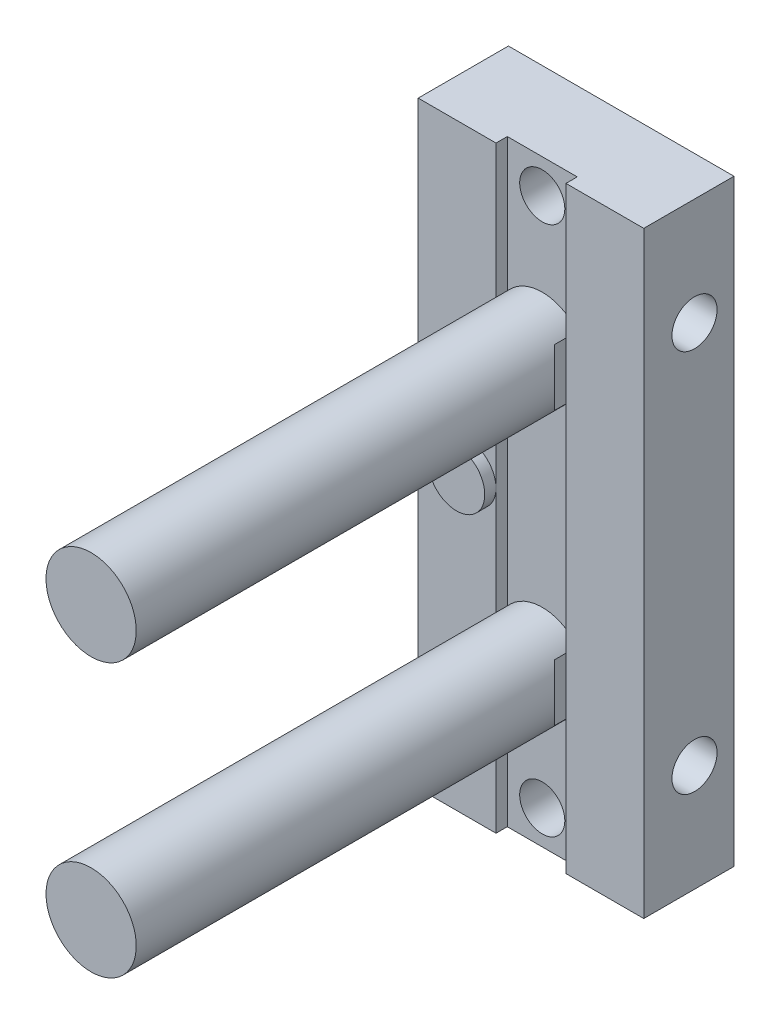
ISO-10303-21;
HEADER;
FILE_DESCRIPTION(('STEP AP214'),'2;1');
FILE_NAME('part.step','',(''),(''),'','','');
FILE_SCHEMA(('AUTOMOTIVE_DESIGN { 1 0 10303 214 1 1 1 1 }'));
ENDSEC;
DATA;
#1=APPLICATION_CONTEXT('core data for automotive mechanical design processes');
#2=APPLICATION_PROTOCOL_DEFINITION('international standard','automotive_design',2000,#1);
#3=PRODUCT_CONTEXT('',#1,'mechanical');
#4=PRODUCT('Part','Part','',(#3));
#5=PRODUCT_RELATED_PRODUCT_CATEGORY('part','',(#4));
#6=PRODUCT_DEFINITION_FORMATION('','',#4);
#7=PRODUCT_DEFINITION_CONTEXT('part definition',#1,'design');
#8=PRODUCT_DEFINITION('design','',#6,#7);
#9=PRODUCT_DEFINITION_SHAPE('','',#8);
#10=(LENGTH_UNIT() NAMED_UNIT(*) SI_UNIT(.MILLI.,.METRE.));
#11=(NAMED_UNIT(*) PLANE_ANGLE_UNIT() SI_UNIT($,.RADIAN.));
#12=(NAMED_UNIT(*) SI_UNIT($,.STERADIAN.) SOLID_ANGLE_UNIT());
#13=UNCERTAINTY_MEASURE_WITH_UNIT(LENGTH_MEASURE(1.E-05),#10,'distance_accuracy_value','');
#14=(GEOMETRIC_REPRESENTATION_CONTEXT(3) GLOBAL_UNCERTAINTY_ASSIGNED_CONTEXT((#13)) GLOBAL_UNIT_ASSIGNED_CONTEXT((#10,
#11,#12)) REPRESENTATION_CONTEXT('',''));
#15=CARTESIAN_POINT('',(0.,0.,0.));
#16=DIRECTION('',(0.,0.,1.));
#17=DIRECTION('',(1.,0.,0.));
#18=AXIS2_PLACEMENT_3D('',#15,#16,#17);
#19=CARTESIAN_POINT('',(0.,10.3679491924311,0.5));
#20=DIRECTION('',(-0.5,-0.866025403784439,0.));
#21=DIRECTION('',(0.866025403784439,-0.5,0.));
#22=AXIS2_PLACEMENT_3D('',#19,#20,#21);
#23=PLANE('',#22);
#24=DIRECTION('',(0.,0.,1.));
#25=VECTOR('',#24,1.);
#26=CARTESIAN_POINT('',(0.,10.3679491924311,0.5));
#27=LINE('',#26,#25);
#28=CARTESIAN_POINT('',(0.,10.3679491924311,2.5));
#29=VERTEX_POINT('',#28);
#30=CARTESIAN_POINT('',(0.,10.3679491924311,0.5));
#31=VERTEX_POINT('',#30);
#32=EDGE_CURVE('E253',#29,#31,#27,.F.);
#33=ORIENTED_EDGE('',*,*,#32,.T.);
#34=DIRECTION('',(0.866025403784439,-0.5,0.));
#35=VECTOR('',#34,1.);
#36=CARTESIAN_POINT('',(0.,10.3679491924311,0.5));
#37=LINE('',#36,#35);
#38=CARTESIAN_POINT('',(-1.5,11.2339745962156,0.5));
#39=VERTEX_POINT('',#38);
#40=EDGE_CURVE('E237',#39,#31,#37,.T.);
#41=ORIENTED_EDGE('',*,*,#40,.F.);
#42=DIRECTION('',(0.,0.,1.));
#43=VECTOR('',#42,1.);
#44=CARTESIAN_POINT('',(-1.5,11.2339745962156,0.5));
#45=LINE('',#44,#43);
#46=CARTESIAN_POINT('',(-1.5,11.2339745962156,2.5));
#47=VERTEX_POINT('',#46);
#48=EDGE_CURVE('E256',#39,#47,#45,.T.);
#49=ORIENTED_EDGE('',*,*,#48,.T.);
#50=DIRECTION('',(0.866025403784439,-0.5,0.));
#51=VECTOR('',#50,1.);
#52=CARTESIAN_POINT('',(0.,10.3679491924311,2.5));
#53=LINE('',#52,#51);
#54=EDGE_CURVE('E241',#29,#47,#53,.F.);
#55=ORIENTED_EDGE('',*,*,#54,.F.);
#56=EDGE_LOOP('',(#33,#41,#49,#55));
#57=FACE_BOUND('',#56,.T.);
#58=ADVANCED_FACE('F33',(#57),#23,.F.);
#59=CARTESIAN_POINT('',(0.,-13.8320508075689,0.5));
#60=DIRECTION('',(-0.500000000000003,-0.866025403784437,0.));
#61=DIRECTION('',(0.866025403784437,-0.500000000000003,0.));
#62=AXIS2_PLACEMENT_3D('',#59,#60,#61);
#63=PLANE('',#62);
#64=DIRECTION('',(0.,0.,1.));
#65=VECTOR('',#64,1.);
#66=CARTESIAN_POINT('',(0.,-13.8320508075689,0.5));
#67=LINE('',#66,#65);
#68=CARTESIAN_POINT('',(0.,-13.8320508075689,2.5));
#69=VERTEX_POINT('',#68);
#70=CARTESIAN_POINT('',(0.,-13.8320508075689,0.5));
#71=VERTEX_POINT('',#70);
#72=EDGE_CURVE('E267',#69,#71,#67,.F.);
#73=ORIENTED_EDGE('',*,*,#72,.T.);
#74=DIRECTION('',(0.866025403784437,-0.500000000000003,0.));
#75=VECTOR('',#74,1.);
#76=CARTESIAN_POINT('',(0.,-13.8320508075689,0.5));
#77=LINE('',#76,#75);
#78=CARTESIAN_POINT('',(-1.5,-12.9660254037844,0.5));
#79=VERTEX_POINT('',#78);
#80=EDGE_CURVE('E245',#79,#71,#77,.T.);
#81=ORIENTED_EDGE('',*,*,#80,.F.);
#82=DIRECTION('',(0.,0.,1.));
#83=VECTOR('',#82,1.);
#84=CARTESIAN_POINT('',(-1.5,-12.9660254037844,0.5));
#85=LINE('',#84,#83);
#86=CARTESIAN_POINT('',(-1.5,-12.9660254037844,2.5));
#87=VERTEX_POINT('',#86);
#88=EDGE_CURVE('E272',#79,#87,#85,.T.);
#89=ORIENTED_EDGE('',*,*,#88,.T.);
#90=DIRECTION('',(0.866025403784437,-0.500000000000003,0.));
#91=VECTOR('',#90,1.);
#92=CARTESIAN_POINT('',(0.,-13.8320508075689,2.5));
#93=LINE('',#92,#91);
#94=EDGE_CURVE('E249',#69,#87,#93,.F.);
#95=ORIENTED_EDGE('',*,*,#94,.F.);
#96=EDGE_LOOP('',(#73,#81,#89,#95));
#97=FACE_BOUND('',#96,.T.);
#98=ADVANCED_FACE('F448',(#97),#63,.F.);
#99=CARTESIAN_POINT('',(1.5,11.2339745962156,0.5));
#100=DIRECTION('',(0.5,-0.866025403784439,0.));
#101=DIRECTION('',(0.866025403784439,0.5,0.));
#102=AXIS2_PLACEMENT_3D('',#99,#100,#101);
#103=PLANE('',#102);
#104=DIRECTION('',(0.,0.,-1.));
#105=VECTOR('',#104,1.);
#106=CARTESIAN_POINT('',(1.5,11.2339745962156,0.5));
#107=LINE('',#106,#105);
#108=CARTESIAN_POINT('',(1.5,11.2339745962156,2.5));
#109=VERTEX_POINT('',#108);
#110=CARTESIAN_POINT('',(1.5,11.2339745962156,0.5));
#111=VERTEX_POINT('',#110);
#112=EDGE_CURVE('E282',#109,#111,#107,.T.);
#113=ORIENTED_EDGE('',*,*,#112,.T.);
#114=DIRECTION('',(0.866025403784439,0.5,0.));
#115=VECTOR('',#114,1.);
#116=CARTESIAN_POINT('',(1.5,11.2339745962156,0.5));
#117=LINE('',#116,#115);
#118=EDGE_CURVE('E239',#31,#111,#117,.T.);
#119=ORIENTED_EDGE('',*,*,#118,.F.);
#120=ORIENTED_EDGE('',*,*,#32,.F.);
#121=DIRECTION('',(0.866025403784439,0.5,0.));
#122=VECTOR('',#121,1.);
#123=CARTESIAN_POINT('',(1.5,11.2339745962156,2.5));
#124=LINE('',#123,#122);
#125=EDGE_CURVE('E244',#109,#29,#124,.F.);
#126=ORIENTED_EDGE('',*,*,#125,.F.);
#127=EDGE_LOOP('',(#113,#119,#120,#126));
#128=FACE_BOUND('',#127,.T.);
#129=ADVANCED_FACE('F446',(#128),#103,.F.);
#130=CARTESIAN_POINT('',(-1.5,11.2339745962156,0.5));
#131=DIRECTION('',(-1.,0.,0.));
#132=DIRECTION('',(0.,0.,1.));
#133=AXIS2_PLACEMENT_3D('',#130,#131,#132);
#134=PLANE('',#133);
#135=ORIENTED_EDGE('',*,*,#48,.F.);
#136=DIRECTION('',(0.,1.,0.));
#137=VECTOR('',#136,1.);
#138=CARTESIAN_POINT('',(-1.5,11.2339745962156,0.5));
#139=LINE('',#138,#137);
#140=CARTESIAN_POINT('',(-1.5,12.9660254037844,0.5));
#141=VERTEX_POINT('',#140);
#142=EDGE_CURVE('E240',#141,#39,#139,.F.);
#143=ORIENTED_EDGE('',*,*,#142,.F.);
#144=DIRECTION('',(0.,0.,1.));
#145=VECTOR('',#144,1.);
#146=CARTESIAN_POINT('',(-1.5,12.9660254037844,0.5));
#147=LINE('',#146,#145);
#148=CARTESIAN_POINT('',(-1.5,12.9660254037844,2.5));
#149=VERTEX_POINT('',#148);
#150=EDGE_CURVE('E287',#141,#149,#147,.T.);
#151=ORIENTED_EDGE('',*,*,#150,.T.);
#152=DIRECTION('',(0.,1.,0.));
#153=VECTOR('',#152,1.);
#154=CARTESIAN_POINT('',(-1.5,11.2339745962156,2.5));
#155=LINE('',#154,#153);
#156=EDGE_CURVE('E243',#47,#149,#155,.T.);
#157=ORIENTED_EDGE('',*,*,#156,.F.);
#158=EDGE_LOOP('',(#135,#143,#151,#157));
#159=FACE_BOUND('',#158,.T.);
#160=ADVANCED_FACE('F441',(#159),#134,.F.);
#161=CARTESIAN_POINT('',(1.5,-12.9660254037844,0.5));
#162=DIRECTION('',(0.499999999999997,-0.86602540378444,0.));
#163=DIRECTION('',(0.86602540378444,0.499999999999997,0.));
#164=AXIS2_PLACEMENT_3D('',#161,#162,#163);
#165=PLANE('',#164);
#166=DIRECTION('',(0.,0.,-1.));
#167=VECTOR('',#166,1.);
#168=CARTESIAN_POINT('',(1.5,-12.9660254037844,0.5));
#169=LINE('',#168,#167);
#170=CARTESIAN_POINT('',(1.5,-12.9660254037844,2.5));
#171=VERTEX_POINT('',#170);
#172=CARTESIAN_POINT('',(1.5,-12.9660254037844,0.5));
#173=VERTEX_POINT('',#172);
#174=EDGE_CURVE('E293',#171,#173,#169,.T.);
#175=ORIENTED_EDGE('',*,*,#174,.T.);
#176=DIRECTION('',(0.86602540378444,0.499999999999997,0.));
#177=VECTOR('',#176,1.);
#178=CARTESIAN_POINT('',(1.5,-12.9660254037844,0.5));
#179=LINE('',#178,#177);
#180=EDGE_CURVE('E247',#71,#173,#179,.T.);
#181=ORIENTED_EDGE('',*,*,#180,.F.);
#182=ORIENTED_EDGE('',*,*,#72,.F.);
#183=DIRECTION('',(0.86602540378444,0.499999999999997,0.));
#184=VECTOR('',#183,1.);
#185=CARTESIAN_POINT('',(1.5,-12.9660254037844,2.5));
#186=LINE('',#185,#184);
#187=EDGE_CURVE('E252',#171,#69,#186,.F.);
#188=ORIENTED_EDGE('',*,*,#187,.F.);
#189=EDGE_LOOP('',(#175,#181,#182,#188));
#190=FACE_BOUND('',#189,.T.);
#191=ADVANCED_FACE('F454',(#190),#165,.F.);
#192=CARTESIAN_POINT('',(-1.5,-12.9660254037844,0.5));
#193=DIRECTION('',(-1.,0.,0.));
#194=DIRECTION('',(0.,0.,1.));
#195=AXIS2_PLACEMENT_3D('',#192,#193,#194);
#196=PLANE('',#195);
#197=ORIENTED_EDGE('',*,*,#88,.F.);
#198=DIRECTION('',(0.,1.,0.));
#199=VECTOR('',#198,1.);
#200=CARTESIAN_POINT('',(-1.5,-12.9660254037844,0.5));
#201=LINE('',#200,#199);
#202=CARTESIAN_POINT('',(-1.5,-11.2339745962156,0.5));
#203=VERTEX_POINT('',#202);
#204=EDGE_CURVE('E248',#203,#79,#201,.F.);
#205=ORIENTED_EDGE('',*,*,#204,.F.);
#206=DIRECTION('',(0.,0.,1.));
#207=VECTOR('',#206,1.);
#208=CARTESIAN_POINT('',(-1.5,-11.2339745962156,0.5));
#209=LINE('',#208,#207);
#210=CARTESIAN_POINT('',(-1.5,-11.2339745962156,2.5));
#211=VERTEX_POINT('',#210);
#212=EDGE_CURVE('E302',#203,#211,#209,.T.);
#213=ORIENTED_EDGE('',*,*,#212,.T.);
#214=DIRECTION('',(0.,1.,0.));
#215=VECTOR('',#214,1.);
#216=CARTESIAN_POINT('',(-1.5,-12.9660254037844,2.5));
#217=LINE('',#216,#215);
#218=EDGE_CURVE('E251',#87,#211,#217,.T.);
#219=ORIENTED_EDGE('',*,*,#218,.F.);
#220=EDGE_LOOP('',(#197,#205,#213,#219));
#221=FACE_BOUND('',#220,.T.);
#222=ADVANCED_FACE('F1495',(#221),#196,.F.);
#223=CARTESIAN_POINT('',(1.5,12.9660254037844,0.5));
#224=DIRECTION('',(1.,0.,0.));
#225=DIRECTION('',(0.,0.,-1.));
#226=AXIS2_PLACEMENT_3D('',#223,#224,#225);
#227=PLANE('',#226);
#228=DIRECTION('',(0.,0.,1.));
#229=VECTOR('',#228,1.);
#230=CARTESIAN_POINT('',(1.5,12.9660254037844,0.5));
#231=LINE('',#230,#229);
#232=CARTESIAN_POINT('',(1.5,12.9660254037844,2.5));
#233=VERTEX_POINT('',#232);
#234=CARTESIAN_POINT('',(1.5,12.9660254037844,0.5));
#235=VERTEX_POINT('',#234);
#236=EDGE_CURVE('E299',#233,#235,#231,.F.);
#237=ORIENTED_EDGE('',*,*,#236,.T.);
#238=DIRECTION('',(0.,1.,0.));
#239=VECTOR('',#238,1.);
#240=CARTESIAN_POINT('',(1.5,12.9660254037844,0.5));
#241=LINE('',#240,#239);
#242=EDGE_CURVE('E259',#111,#235,#241,.T.);
#243=ORIENTED_EDGE('',*,*,#242,.F.);
#244=ORIENTED_EDGE('',*,*,#112,.F.);
#245=DIRECTION('',(0.,1.,0.));
#246=VECTOR('',#245,1.);
#247=CARTESIAN_POINT('',(1.5,12.1,2.5));
#248=LINE('',#247,#246);
#249=EDGE_CURVE('E297',#109,#233,#248,.T.);
#250=ORIENTED_EDGE('',*,*,#249,.T.);
#251=EDGE_LOOP('',(#237,#243,#244,#250));
#252=FACE_BOUND('',#251,.T.);
#253=ADVANCED_FACE('F430',(#252),#227,.F.);
#254=CARTESIAN_POINT('',(-1.5,12.9660254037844,0.5));
#255=DIRECTION('',(-0.5,0.866025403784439,0.));
#256=DIRECTION('',(-0.866025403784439,-0.5,0.));
#257=AXIS2_PLACEMENT_3D('',#254,#255,#256);
#258=PLANE('',#257);
#259=ORIENTED_EDGE('',*,*,#150,.F.);
#260=DIRECTION('',(-0.866025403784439,-0.5,0.));
#261=VECTOR('',#260,1.);
#262=CARTESIAN_POINT('',(-1.5,12.9660254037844,0.5));
#263=LINE('',#262,#261);
#264=CARTESIAN_POINT('',(0.,13.8320508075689,0.5));
#265=VERTEX_POINT('',#264);
#266=EDGE_CURVE('E264',#265,#141,#263,.T.);
#267=ORIENTED_EDGE('',*,*,#266,.F.);
#268=DIRECTION('',(0.,0.,1.));
#269=VECTOR('',#268,1.);
#270=CARTESIAN_POINT('',(0.,13.8320508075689,0.5));
#271=LINE('',#270,#269);
#272=CARTESIAN_POINT('',(0.,13.8320508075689,2.5));
#273=VERTEX_POINT('',#272);
#274=EDGE_CURVE('E296',#265,#273,#271,.T.);
#275=ORIENTED_EDGE('',*,*,#274,.T.);
#276=DIRECTION('',(-0.866025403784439,-0.499999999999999,0.));
#277=VECTOR('',#276,1.);
#278=CARTESIAN_POINT('',(0.,13.8320508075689,2.5));
#279=LINE('',#278,#277);
#280=EDGE_CURVE('E262',#273,#149,#279,.T.);
#281=ORIENTED_EDGE('',*,*,#280,.T.);
#282=EDGE_LOOP('',(#259,#267,#275,#281));
#283=FACE_BOUND('',#282,.T.);
#284=ADVANCED_FACE('F438',(#283),#258,.F.);
#285=CARTESIAN_POINT('',(0.,12.1,2.5));
#286=DIRECTION('',(0.,0.,1.));
#287=DIRECTION('',(1.,0.,0.));
#288=AXIS2_PLACEMENT_3D('',#285,#286,#287);
#289=PLANE('',#288);
#290=ORIENTED_EDGE('',*,*,#249,.F.);
#291=ORIENTED_EDGE('',*,*,#125,.T.);
#292=ORIENTED_EDGE('',*,*,#54,.T.);
#293=ORIENTED_EDGE('',*,*,#156,.T.);
#294=ORIENTED_EDGE('',*,*,#280,.F.);
#295=DIRECTION('',(-0.866025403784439,0.5,0.));
#296=VECTOR('',#295,1.);
#297=CARTESIAN_POINT('',(0.,13.8320508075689,2.5));
#298=LINE('',#297,#296);
#299=EDGE_CURVE('E269',#273,#233,#298,.F.);
#300=ORIENTED_EDGE('',*,*,#299,.T.);
#301=EDGE_LOOP('',(#290,#291,#292,#293,#294,#300));
#302=FACE_BOUND('',#301,.T.);
#303=ADVANCED_FACE('F434',(#302),#289,.F.);
#304=CARTESIAN_POINT('',(1.5,-11.2339745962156,0.5));
#305=DIRECTION('',(1.,0.,0.));
#306=DIRECTION('',(0.,0.,-1.));
#307=AXIS2_PLACEMENT_3D('',#304,#305,#306);
#308=PLANE('',#307);
#309=DIRECTION('',(0.,0.,1.));
#310=VECTOR('',#309,1.);
#311=CARTESIAN_POINT('',(1.5,-11.2339745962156,0.5));
#312=LINE('',#311,#310);
#313=CARTESIAN_POINT('',(1.5,-11.2339745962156,2.5));
#314=VERTEX_POINT('',#313);
#315=CARTESIAN_POINT('',(1.5,-11.2339745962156,0.5));
#316=VERTEX_POINT('',#315);
#317=EDGE_CURVE('E313',#314,#316,#312,.F.);
#318=ORIENTED_EDGE('',*,*,#317,.T.);
#319=DIRECTION('',(0.,1.,0.));
#320=VECTOR('',#319,1.);
#321=CARTESIAN_POINT('',(1.5,-11.2339745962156,0.5));
#322=LINE('',#321,#320);
#323=EDGE_CURVE('E274',#173,#316,#322,.T.);
#324=ORIENTED_EDGE('',*,*,#323,.F.);
#325=ORIENTED_EDGE('',*,*,#174,.F.);
#326=DIRECTION('',(0.,1.,0.));
#327=VECTOR('',#326,1.);
#328=CARTESIAN_POINT('',(1.5,-12.1,2.5));
#329=LINE('',#328,#327);
#330=EDGE_CURVE('E311',#171,#314,#329,.T.);
#331=ORIENTED_EDGE('',*,*,#330,.T.);
#332=EDGE_LOOP('',(#318,#324,#325,#331));
#333=FACE_BOUND('',#332,.T.);
#334=ADVANCED_FACE('F1464',(#333),#308,.F.);
#335=CARTESIAN_POINT('',(-1.5,-11.2339745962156,0.5));
#336=DIRECTION('',(-0.499999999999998,0.86602540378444,0.));
#337=DIRECTION('',(-0.86602540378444,-0.499999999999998,0.));
#338=AXIS2_PLACEMENT_3D('',#335,#336,#337);
#339=PLANE('',#338);
#340=ORIENTED_EDGE('',*,*,#212,.F.);
#341=DIRECTION('',(-0.86602540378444,-0.499999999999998,0.));
#342=VECTOR('',#341,1.);
#343=CARTESIAN_POINT('',(-1.5,-11.2339745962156,0.5));
#344=LINE('',#343,#342);
#345=CARTESIAN_POINT('',(0.,-10.3679491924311,0.5));
#346=VERTEX_POINT('',#345);
#347=EDGE_CURVE('E279',#346,#203,#344,.T.);
#348=ORIENTED_EDGE('',*,*,#347,.F.);
#349=DIRECTION('',(0.,0.,1.));
#350=VECTOR('',#349,1.);
#351=CARTESIAN_POINT('',(0.,-10.3679491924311,0.5));
#352=LINE('',#351,#350);
#353=CARTESIAN_POINT('',(0.,-10.3679491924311,2.5));
#354=VERTEX_POINT('',#353);
#355=EDGE_CURVE('E310',#346,#354,#352,.T.);
#356=ORIENTED_EDGE('',*,*,#355,.T.);
#357=DIRECTION('',(-0.86602540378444,-0.499999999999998,0.));
#358=VECTOR('',#357,1.);
#359=CARTESIAN_POINT('',(0.,-10.3679491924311,2.5));
#360=LINE('',#359,#358);
#361=EDGE_CURVE('E277',#354,#211,#360,.T.);
#362=ORIENTED_EDGE('',*,*,#361,.T.);
#363=EDGE_LOOP('',(#340,#348,#356,#362));
#364=FACE_BOUND('',#363,.T.);
#365=ADVANCED_FACE('F1455',(#364),#339,.F.);
#366=CARTESIAN_POINT('',(0.,-12.1,2.5));
#367=DIRECTION('',(0.,0.,1.));
#368=DIRECTION('',(1.,0.,0.));
#369=AXIS2_PLACEMENT_3D('',#366,#367,#368);
#370=PLANE('',#369);
#371=ORIENTED_EDGE('',*,*,#330,.F.);
#372=ORIENTED_EDGE('',*,*,#187,.T.);
#373=ORIENTED_EDGE('',*,*,#94,.T.);
#374=ORIENTED_EDGE('',*,*,#218,.T.);
#375=ORIENTED_EDGE('',*,*,#361,.F.);
#376=DIRECTION('',(-0.866025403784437,0.500000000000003,0.));
#377=VECTOR('',#376,1.);
#378=CARTESIAN_POINT('',(0.,-10.3679491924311,2.5));
#379=LINE('',#378,#377);
#380=EDGE_CURVE('E284',#354,#314,#379,.F.);
#381=ORIENTED_EDGE('',*,*,#380,.T.);
#382=EDGE_LOOP('',(#371,#372,#373,#374,#375,#381));
#383=FACE_BOUND('',#382,.T.);
#384=ADVANCED_FACE('F1448',(#383),#370,.F.);
#385=CARTESIAN_POINT('',(0.,13.8320508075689,0.5));
#386=DIRECTION('',(0.5,0.866025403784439,0.));
#387=DIRECTION('',(-0.866025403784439,0.5,0.));
#388=AXIS2_PLACEMENT_3D('',#385,#386,#387);
#389=PLANE('',#388);
#390=ORIENTED_EDGE('',*,*,#274,.F.);
#391=DIRECTION('',(0.866025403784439,-0.499999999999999,0.));
#392=VECTOR('',#391,1.);
#393=CARTESIAN_POINT('',(0.,13.8320508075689,0.5));
#394=LINE('',#393,#392);
#395=EDGE_CURVE('E324',#265,#235,#394,.T.);
#396=ORIENTED_EDGE('',*,*,#395,.T.);
#397=ORIENTED_EDGE('',*,*,#236,.F.);
#398=ORIENTED_EDGE('',*,*,#299,.F.);
#399=EDGE_LOOP('',(#390,#396,#397,#398));
#400=FACE_BOUND('',#399,.T.);
#401=ADVANCED_FACE('F422',(#400),#389,.F.);
#402=CARTESIAN_POINT('',(0.,-10.3679491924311,0.5));
#403=DIRECTION('',(0.500000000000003,0.866025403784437,0.));
#404=DIRECTION('',(-0.866025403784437,0.500000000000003,0.));
#405=AXIS2_PLACEMENT_3D('',#402,#403,#404);
#406=PLANE('',#405);
#407=ORIENTED_EDGE('',*,*,#355,.F.);
#408=DIRECTION('',(0.866025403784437,-0.500000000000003,0.));
#409=VECTOR('',#408,1.);
#410=CARTESIAN_POINT('',(0.,-10.3679491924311,0.5));
#411=LINE('',#410,#409);
#412=EDGE_CURVE('E290',#346,#316,#411,.T.);
#413=ORIENTED_EDGE('',*,*,#412,.T.);
#414=ORIENTED_EDGE('',*,*,#317,.F.);
#415=ORIENTED_EDGE('',*,*,#380,.F.);
#416=EDGE_LOOP('',(#407,#413,#414,#415));
#417=FACE_BOUND('',#416,.T.);
#418=ADVANCED_FACE('F407',(#417),#406,.F.);
#419=CARTESIAN_POINT('',(0.,12.1,0.5));
#420=DIRECTION('',(0.,0.,1.));
#421=DIRECTION('',(1.,0.,0.));
#422=AXIS2_PLACEMENT_3D('',#419,#420,#421);
#423=PLANE('',#422);
#424=ORIENTED_EDGE('',*,*,#266,.T.);
#425=ORIENTED_EDGE('',*,*,#142,.T.);
#426=ORIENTED_EDGE('',*,*,#40,.T.);
#427=ORIENTED_EDGE('',*,*,#118,.T.);
#428=ORIENTED_EDGE('',*,*,#242,.T.);
#429=ORIENTED_EDGE('',*,*,#395,.F.);
#430=EDGE_LOOP('',(#424,#425,#426,#427,#428,#429));
#431=FACE_BOUND('',#430,.T.);
#432=CARTESIAN_POINT('',(0.,12.1,0.5));
#433=DIRECTION('',(0.,0.,1.));
#434=DIRECTION('',(-1.,0.,0.));
#435=AXIS2_PLACEMENT_3D('',#432,#433,#434);
#436=CIRCLE('',#435,2.5);
#437=CARTESIAN_POINT('',(-2.5,12.1,0.5));
#438=VERTEX_POINT('',#437);
#439=EDGE_CURVE('E519',#438,#438,#436,.T.);
#440=ORIENTED_EDGE('',*,*,#439,.F.);
#441=EDGE_LOOP('',(#440));
#442=FACE_BOUND('',#441,.T.);
#443=ADVANCED_FACE('F402',(#431,#442),#423,.F.);
#444=CARTESIAN_POINT('',(0.,-12.1,0.5));
#445=DIRECTION('',(0.,0.,1.));
#446=DIRECTION('',(1.,0.,0.));
#447=AXIS2_PLACEMENT_3D('',#444,#445,#446);
#448=PLANE('',#447);
#449=ORIENTED_EDGE('',*,*,#347,.T.);
#450=ORIENTED_EDGE('',*,*,#204,.T.);
#451=ORIENTED_EDGE('',*,*,#80,.T.);
#452=ORIENTED_EDGE('',*,*,#180,.T.);
#453=ORIENTED_EDGE('',*,*,#323,.T.);
#454=ORIENTED_EDGE('',*,*,#412,.F.);
#455=EDGE_LOOP('',(#449,#450,#451,#452,#453,#454));
#456=FACE_BOUND('',#455,.T.);
#457=CARTESIAN_POINT('',(0.,-12.1,0.5));
#458=DIRECTION('',(0.,0.,1.));
#459=DIRECTION('',(-1.,0.,0.));
#460=AXIS2_PLACEMENT_3D('',#457,#458,#459);
#461=CIRCLE('',#460,2.5);
#462=CARTESIAN_POINT('',(-2.5,-12.1,0.5));
#463=VERTEX_POINT('',#462);
#464=EDGE_CURVE('E387',#463,#463,#461,.T.);
#465=ORIENTED_EDGE('',*,*,#464,.F.);
#466=EDGE_LOOP('',(#465));
#467=FACE_BOUND('',#466,.T.);
#468=ADVANCED_FACE('F393',(#456,#467),#448,.F.);
#469=CARTESIAN_POINT('',(0.,12.1,3.5));
#470=DIRECTION('',(0.,0.,1.));
#471=DIRECTION('',(1.,0.,0.));
#472=AXIS2_PLACEMENT_3D('',#469,#470,#471);
#473=PLANE('',#472);
#474=CARTESIAN_POINT('',(0.,12.1,3.5));
#475=DIRECTION('',(0.,0.,1.));
#476=DIRECTION('',(1.,0.,0.));
#477=AXIS2_PLACEMENT_3D('',#474,#475,#476);
#478=CIRCLE('',#477,3.5);
#479=CARTESIAN_POINT('',(1.95959179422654,15.,3.5));
#480=VERTEX_POINT('',#479);
#481=CARTESIAN_POINT('',(-1.95959179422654,15.,3.5));
#482=VERTEX_POINT('',#481);
#483=EDGE_CURVE('E304',#480,#482,#478,.F.);
#484=ORIENTED_EDGE('',*,*,#483,.T.);
#485=DIRECTION('',(1.,0.,0.));
#486=VECTOR('',#485,1.);
#487=CARTESIAN_POINT('',(0.,15.,3.5));
#488=LINE('',#487,#486);
#489=CARTESIAN_POINT('',(-0.768114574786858,15.,3.5));
#490=VERTEX_POINT('',#489);
#491=EDGE_CURVE('E894',#490,#482,#488,.F.);
#492=ORIENTED_EDGE('',*,*,#491,.F.);
#493=CARTESIAN_POINT('',(0.,12.1,3.5));
#494=DIRECTION('',(0.,0.,-1.));
#495=DIRECTION('',(-1.,0.,0.));
#496=AXIS2_PLACEMENT_3D('',#493,#494,#495);
#497=CIRCLE('',#496,3.);
#498=CARTESIAN_POINT('',(0.768114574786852,15.,3.5));
#499=VERTEX_POINT('',#498);
#500=EDGE_CURVE('E520',#499,#490,#497,.T.);
#501=ORIENTED_EDGE('',*,*,#500,.F.);
#502=DIRECTION('',(1.,0.,0.));
#503=VECTOR('',#502,1.);
#504=CARTESIAN_POINT('',(0.,15.,3.5));
#505=LINE('',#504,#503);
#506=EDGE_CURVE('E350',#480,#499,#505,.F.);
#507=ORIENTED_EDGE('',*,*,#506,.F.);
#508=EDGE_LOOP('',(#484,#492,#501,#507));
#509=FACE_BOUND('',#508,.T.);
#510=ADVANCED_FACE('F343',(#509),#473,.F.);
#511=CARTESIAN_POINT('',(0.,12.1,1.));
#512=DIRECTION('',(0.,0.,1.));
#513=DIRECTION('',(1.,0.,0.));
#514=AXIS2_PLACEMENT_3D('',#511,#512,#513);
#515=TOROIDAL_SURFACE('',#514,2.5,0.5);
#516=CARTESIAN_POINT('',(0.,12.1,1.));
#517=DIRECTION('',(0.,0.,-1.));
#518=DIRECTION('',(-1.,0.,0.));
#519=AXIS2_PLACEMENT_3D('',#516,#517,#518);
#520=CIRCLE('',#519,3.);
#521=CARTESIAN_POINT('',(-3.,12.1,1.));
#522=VERTEX_POINT('',#521);
#523=EDGE_CURVE('E612',#522,#522,#520,.F.);
#524=ORIENTED_EDGE('',*,*,#523,.F.);
#525=EDGE_LOOP('',(#524));
#526=FACE_BOUND('',#525,.T.);
#527=ORIENTED_EDGE('',*,*,#439,.T.);
#528=EDGE_LOOP('',(#527));
#529=FACE_BOUND('',#528,.T.);
#530=ADVANCED_FACE('F331',(#526,#529),#515,.T.);
#531=CARTESIAN_POINT('',(0.,-12.1,3.5));
#532=DIRECTION('',(0.,0.,1.));
#533=DIRECTION('',(1.,0.,0.));
#534=AXIS2_PLACEMENT_3D('',#531,#532,#533);
#535=PLANE('',#534);
#536=CARTESIAN_POINT('',(0.,-12.1,3.5));
#537=DIRECTION('',(0.,0.,1.));
#538=DIRECTION('',(1.,0.,0.));
#539=AXIS2_PLACEMENT_3D('',#536,#537,#538);
#540=CIRCLE('',#539,3.5);
#541=CARTESIAN_POINT('',(-1.95959179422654,-15.,3.5));
#542=VERTEX_POINT('',#541);
#543=CARTESIAN_POINT('',(1.95959179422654,-15.,3.5));
#544=VERTEX_POINT('',#543);
#545=EDGE_CURVE('E525',#542,#544,#540,.F.);
#546=ORIENTED_EDGE('',*,*,#545,.T.);
#547=DIRECTION('',(1.,0.,0.));
#548=VECTOR('',#547,1.);
#549=CARTESIAN_POINT('',(0.,-15.,3.5));
#550=LINE('',#549,#548);
#551=CARTESIAN_POINT('',(0.768114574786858,-15.,3.5));
#552=VERTEX_POINT('',#551);
#553=EDGE_CURVE('E352',#552,#544,#550,.T.);
#554=ORIENTED_EDGE('',*,*,#553,.F.);
#555=CARTESIAN_POINT('',(0.,-12.1,3.5));
#556=DIRECTION('',(0.,0.,-1.));
#557=DIRECTION('',(-1.,0.,0.));
#558=AXIS2_PLACEMENT_3D('',#555,#556,#557);
#559=CIRCLE('',#558,3.);
#560=CARTESIAN_POINT('',(-0.768114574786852,-15.,3.5));
#561=VERTEX_POINT('',#560);
#562=EDGE_CURVE('E528',#561,#552,#559,.T.);
#563=ORIENTED_EDGE('',*,*,#562,.F.);
#564=DIRECTION('',(1.,0.,0.));
#565=VECTOR('',#564,1.);
#566=CARTESIAN_POINT('',(0.,-15.,3.5));
#567=LINE('',#566,#565);
#568=EDGE_CURVE('E355',#542,#561,#567,.T.);
#569=ORIENTED_EDGE('',*,*,#568,.F.);
#570=EDGE_LOOP('',(#546,#554,#563,#569));
#571=FACE_BOUND('',#570,.T.);
#572=ADVANCED_FACE('F342',(#571),#535,.F.);
#573=CARTESIAN_POINT('',(0.,-12.1,1.));
#574=DIRECTION('',(0.,0.,1.));
#575=DIRECTION('',(1.,0.,0.));
#576=AXIS2_PLACEMENT_3D('',#573,#574,#575);
#577=TOROIDAL_SURFACE('',#576,2.5,0.5);
#578=CARTESIAN_POINT('',(0.,-12.1,1.));
#579=DIRECTION('',(0.,0.,-1.));
#580=DIRECTION('',(-1.,0.,0.));
#581=AXIS2_PLACEMENT_3D('',#578,#579,#580);
#582=CIRCLE('',#581,3.);
#583=CARTESIAN_POINT('',(-3.,-12.1,1.));
#584=VERTEX_POINT('',#583);
#585=EDGE_CURVE('E601',#584,#584,#582,.F.);
#586=ORIENTED_EDGE('',*,*,#585,.F.);
#587=EDGE_LOOP('',(#586));
#588=FACE_BOUND('',#587,.T.);
#589=ORIENTED_EDGE('',*,*,#464,.T.);
#590=EDGE_LOOP('',(#589));
#591=FACE_BOUND('',#590,.T.);
#592=ADVANCED_FACE('F363',(#588,#591),#577,.T.);
#593=CARTESIAN_POINT('',(0.,12.1,0.));
#594=DIRECTION('',(0.,0.,1.));
#595=DIRECTION('',(1.,0.,0.));
#596=AXIS2_PLACEMENT_3D('',#593,#594,#595);
#597=CYLINDRICAL_SURFACE('',#596,3.5);
#598=ORIENTED_EDGE('',*,*,#483,.F.);
#599=CARTESIAN_POINT('',(1.95959179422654,15.,3.5));
#600=CARTESIAN_POINT('',(1.95959569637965,14.9999915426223,3.46490311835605));
#601=CARTESIAN_POINT('',(1.95822472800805,15.0009236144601,3.42981012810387));
#602=CARTESIAN_POINT('',(1.95276381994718,15.004605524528,3.35994585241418));
#603=CARTESIAN_POINT('',(1.94867494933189,15.0073546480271,3.32517444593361));
#604=CARTESIAN_POINT('',(1.93783910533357,15.0145873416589,3.25643042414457));
#605=CARTESIAN_POINT('',(1.93110700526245,15.0190612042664,3.22245444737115));
#606=CARTESIAN_POINT('',(1.91505020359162,15.0296202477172,3.15538662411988));
#607=CARTESIAN_POINT('',(1.90572539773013,15.0357054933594,3.1222948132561));
#608=CARTESIAN_POINT('',(1.87398835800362,15.0561470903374,3.02479021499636));
#609=CARTESIAN_POINT('',(1.84779260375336,15.072703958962,2.96201691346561));
#610=CARTESIAN_POINT('',(1.78622658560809,15.1100967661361,2.842579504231));
#611=CARTESIAN_POINT('',(1.75084918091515,15.1309360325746,2.7859202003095));
#612=CARTESIAN_POINT('',(1.67218811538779,15.1750295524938,2.67976895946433));
#613=CARTESIAN_POINT('',(1.62892704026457,15.1982768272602,2.63025725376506));
#614=CARTESIAN_POINT('',(1.53570066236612,15.2455306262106,2.53848782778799));
#615=CARTESIAN_POINT('',(1.48573277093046,15.2695374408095,2.49623292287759));
#616=CARTESIAN_POINT('',(1.35546633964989,15.3279854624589,2.40052755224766));
#617=CARTESIAN_POINT('',(1.27196545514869,15.3620166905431,2.35117522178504));
#618=CARTESIAN_POINT('',(1.09650135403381,15.4251196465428,2.26607276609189));
#619=CARTESIAN_POINT('',(1.00451982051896,15.4541802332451,2.23035298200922));
#620=CARTESIAN_POINT('',(0.849643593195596,15.4958814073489,2.18157878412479));
#621=CARTESIAN_POINT('',(0.78837613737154,15.5106449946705,2.16500935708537));
#622=CARTESIAN_POINT('',(0.664144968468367,15.536995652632,2.13618085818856));
#623=CARTESIAN_POINT('',(0.601180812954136,15.5485818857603,2.12392292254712));
#624=CARTESIAN_POINT('',(0.474067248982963,15.5683424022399,2.10337542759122));
#625=CARTESIAN_POINT('',(0.409917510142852,15.5765157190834,2.09508699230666));
#626=CARTESIAN_POINT('',(0.280887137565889,15.5893143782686,2.08224034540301));
#627=CARTESIAN_POINT('',(0.216006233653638,15.5939383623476,2.07768356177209));
#628=CARTESIAN_POINT('',(0.0195357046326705,15.6024094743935,2.06931873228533));
#629=CARTESIAN_POINT('',(-0.112613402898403,15.6006563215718,2.07101241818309));
#630=CARTESIAN_POINT('',(-0.374801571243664,15.582353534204,2.08916953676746));
#631=CARTESIAN_POINT('',(-0.504841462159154,15.5658098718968,2.10562700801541));
#632=CARTESIAN_POINT('',(-0.741436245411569,15.5223766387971,2.15186155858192));
#633=CARTESIAN_POINT('',(-0.848737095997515,15.4972517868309,2.17946085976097));
#634=CARTESIAN_POINT('',(-1.05603922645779,15.438609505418,2.24934214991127));
#635=CARTESIAN_POINT('',(-1.15605063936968,15.4051040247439,2.2916032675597));
#636=CARTESIAN_POINT('',(-1.32257893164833,15.3414172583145,2.3813591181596));
#637=CARTESIAN_POINT('',(-1.39143378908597,15.3123143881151,2.42527138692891));
#638=CARTESIAN_POINT('',(-1.520381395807,15.2533224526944,2.52408244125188));
#639=CARTESIAN_POINT('',(-1.58048636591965,15.2234345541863,2.5789656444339));
#640=CARTESIAN_POINT('',(-1.68038317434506,15.1706617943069,2.68968005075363));
#641=CARTESIAN_POINT('',(-1.72189123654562,15.1474445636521,2.74379924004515));
#642=CARTESIAN_POINT('',(-1.7958807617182,15.1044378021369,2.85919889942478));
#643=CARTESIAN_POINT('',(-1.82836110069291,15.084648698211,2.92048025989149));
#644=CARTESIAN_POINT('',(-1.88328109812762,15.0503081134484,3.04925699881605));
#645=CARTESIAN_POINT('',(-1.90565654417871,15.0357902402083,3.11678891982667));
#646=CARTESIAN_POINT('',(-1.93919121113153,15.0137521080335,3.25560892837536));
#647=CARTESIAN_POINT('',(-1.95037620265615,15.0062157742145,3.32688798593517));
#648=CARTESIAN_POINT('',(-1.95705504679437,15.0017123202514,3.41552268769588));
#649=CARTESIAN_POINT('',(-1.95800676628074,15.0010702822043,3.43241089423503));
#650=CARTESIAN_POINT('',(-1.95927410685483,15.0002149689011,3.46619697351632));
#651=CARTESIAN_POINT('',(-1.95959066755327,15.0000010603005,3.48309479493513));
#652=CARTESIAN_POINT('',(-1.95959179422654,15.,3.5));
#653=B_SPLINE_CURVE_WITH_KNOTS('',3,(#599,#600,#601,#602,#603,#604,#605,#606,#607,#608,#609,
#610,#611,#612,#613,#614,#615,#616,#617,#618,#619,#620,#621,#622,#623,#624,#625,#626,#627,#628,
#629,#630,#631,#632,#633,#634,#635,#636,#637,#638,#639,#640,#641,#642,#643,#644,#645,#646,#647,
#648,#649,#650,#651,#652),.UNSPECIFIED.,.F.,.F.,(4,2,2,2,2,2,2,2,2,2,2,2,2,2,2,2,2,2,2,2,2,2,2,
2,2,2,4),(0.,0.105245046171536,0.210448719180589,0.315068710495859,0.419692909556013,
0.628545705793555,0.837561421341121,1.0459874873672,1.25449423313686,1.56118851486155,
1.86856146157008,2.06382656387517,2.25914308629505,2.45451488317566,2.64996140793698,
3.04470776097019,3.43929479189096,3.77884957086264,4.11792295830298,4.37706183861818,
4.63583523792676,4.85108499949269,5.06636154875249,5.28298747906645,5.49911338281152,
5.54988508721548,5.60058162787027),.UNSPECIFIED.);
#654=EDGE_CURVE('E533',#480,#482,#653,.T.);
#655=ORIENTED_EDGE('',*,*,#654,.T.);
#656=EDGE_LOOP('',(#598,#655));
#657=FACE_BOUND('',#656,.T.);
#658=CARTESIAN_POINT('',(0.,12.1,0.500000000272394));
#659=DIRECTION('',(0.,0.,-1.));
#660=DIRECTION('',(1.,0.,0.));
#661=AXIS2_PLACEMENT_3D('',#658,#659,#660);
#662=CIRCLE('',#661,3.50000000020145);
#663=CARTESIAN_POINT('',(3.50000000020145,12.1,0.500000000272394));
#664=VERTEX_POINT('',#663);
#665=EDGE_CURVE('E540',#664,#664,#662,.T.);
#666=ORIENTED_EDGE('',*,*,#665,.T.);
#667=EDGE_LOOP('',(#666));
#668=FACE_BOUND('',#667,.T.);
#669=ADVANCED_FACE('F367',(#657,#668),#597,.F.);
#670=CARTESIAN_POINT('',(0.,12.1,3.5));
#671=DIRECTION('',(0.,0.,-1.));
#672=DIRECTION('',(-1.,0.,0.));
#673=AXIS2_PLACEMENT_3D('',#670,#671,#672);
#674=CYLINDRICAL_SURFACE('',#673,3.);
#675=ORIENTED_EDGE('',*,*,#523,.T.);
#676=EDGE_LOOP('',(#675));
#677=FACE_BOUND('',#676,.T.);
#678=CARTESIAN_POINT('',(-0.768114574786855,15.,3.5));
#679=CARTESIAN_POINT('',(-0.768176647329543,14.9999645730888,3.46688516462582));
#680=CARTESIAN_POINT('',(-0.765015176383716,15.000821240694,3.43383096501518));
#681=CARTESIAN_POINT('',(-0.752762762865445,15.004034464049,3.36913448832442));
#682=CARTESIAN_POINT('',(-0.743711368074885,15.0063810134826,3.33748428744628));
#683=CARTESIAN_POINT('',(-0.720202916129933,15.0122919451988,3.27646525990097));
#684=CARTESIAN_POINT('',(-0.705754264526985,15.0158544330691,3.24709297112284));
#685=CARTESIAN_POINT('',(-0.672191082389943,15.0237745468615,3.19124753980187));
#686=CARTESIAN_POINT('',(-0.653070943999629,15.0281331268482,3.16477793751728));
#687=CARTESIAN_POINT('',(-0.611102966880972,15.037177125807,3.11534944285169));
#688=CARTESIAN_POINT('',(-0.588277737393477,15.0418604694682,3.09237079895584));
#689=CARTESIAN_POINT('',(-0.539585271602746,15.05117992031,3.04991910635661));
#690=CARTESIAN_POINT('',(-0.513717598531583,15.0558160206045,3.03044656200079));
#691=CARTESIAN_POINT('',(-0.454791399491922,15.0655025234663,2.99188209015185));
#692=CARTESIAN_POINT('',(-0.421272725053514,15.0704796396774,2.97347572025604));
#693=CARTESIAN_POINT('',(-0.351894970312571,15.0794961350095,2.94148351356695));
#694=CARTESIAN_POINT('',(-0.316034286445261,15.0835348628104,2.92790102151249));
#695=CARTESIAN_POINT('',(-0.236107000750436,15.0910097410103,2.90338329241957));
#696=CARTESIAN_POINT('',(-0.191732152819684,15.0942035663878,2.89337564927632));
#697=CARTESIAN_POINT('',(-0.101914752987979,15.0986064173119,2.87971596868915));
#698=CARTESIAN_POINT('',(-0.0564715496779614,15.0998141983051,2.8760679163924));
#699=CARTESIAN_POINT('',(0.0403269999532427,15.1001667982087,2.8749899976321));
#700=CARTESIAN_POINT('',(0.0916954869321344,15.099028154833,2.87841466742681));
#701=CARTESIAN_POINT('',(0.193176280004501,15.0942053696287,2.89336344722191));
#702=CARTESIAN_POINT('',(0.243287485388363,15.0905190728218,2.9048944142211));
#703=CARTESIAN_POINT('',(0.340969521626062,15.0809668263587,2.93645127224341));
#704=CARTESIAN_POINT('',(0.388520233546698,15.075085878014,2.95653575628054));
#705=CARTESIAN_POINT('',(0.478601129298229,15.0619252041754,3.00552559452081));
#706=CARTESIAN_POINT('',(0.521143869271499,15.0546491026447,3.03440820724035));
#707=CARTESIAN_POINT('',(0.585957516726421,15.0423403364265,3.09001366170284));
#708=CARTESIAN_POINT('',(0.610303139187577,15.0373537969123,3.11434304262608));
#709=CARTESIAN_POINT('',(0.654691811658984,15.0277794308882,3.16675259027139));
#710=CARTESIAN_POINT('',(0.674736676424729,15.0231914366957,3.19483116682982));
#711=CARTESIAN_POINT('',(0.70970622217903,15.0149005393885,3.25445579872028));
#712=CARTESIAN_POINT('',(0.724589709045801,15.011204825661,3.28602721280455));
#713=CARTESIAN_POINT('',(0.748112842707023,15.0052500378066,3.351525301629));
#714=CARTESIAN_POINT('',(0.756765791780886,15.0029879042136,3.38544678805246));
#715=CARTESIAN_POINT('',(0.764051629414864,15.0010736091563,3.43312662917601));
#716=CARTESIAN_POINT('',(0.765574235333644,15.0006718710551,3.4464602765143));
#717=CARTESIAN_POINT('',(0.767604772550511,15.0001351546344,3.4731932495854));
#718=CARTESIAN_POINT('',(0.768113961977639,14.9999998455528,3.48659247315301));
#719=CARTESIAN_POINT('',(0.768114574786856,15.,3.5));
#720=B_SPLINE_CURVE_WITH_KNOTS('',3,(#678,#679,#680,#681,#682,#683,#684,#685,#686,#687,#688,
#689,#690,#691,#692,#693,#694,#695,#696,#697,#698,#699,#700,#701,#702,#703,#704,#705,#706,#707,
#708,#709,#710,#711,#712,#713,#714,#715,#716,#717,#718,#719),.UNSPECIFIED.,.F.,.F.,(4,2,2,2,2,2,
2,2,2,2,2,2,2,2,2,2,2,2,2,2,4),(0.,0.0990874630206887,0.19751637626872,0.295792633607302,
0.39418745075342,0.492002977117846,0.589832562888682,0.705087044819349,0.820421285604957,
0.956683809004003,1.09303168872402,1.24680995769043,1.40071846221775,1.55569866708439,
1.71028162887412,1.81421151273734,1.91809745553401,2.02279441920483,2.12726718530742,
2.16751305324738,2.20770892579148),.UNSPECIFIED.);
#721=EDGE_CURVE('E524',#490,#499,#720,.T.);
#722=ORIENTED_EDGE('',*,*,#721,.T.);
#723=ORIENTED_EDGE('',*,*,#500,.T.);
#724=EDGE_LOOP('',(#722,#723));
#725=FACE_BOUND('',#724,.T.);
#726=ADVANCED_FACE('F578',(#677,#725),#674,.T.);
#727=CARTESIAN_POINT('',(0.,-12.1,0.));
#728=DIRECTION('',(0.,0.,1.));
#729=DIRECTION('',(1.,0.,0.));
#730=AXIS2_PLACEMENT_3D('',#727,#728,#729);
#731=CYLINDRICAL_SURFACE('',#730,3.5);
#732=ORIENTED_EDGE('',*,*,#545,.F.);
#733=CARTESIAN_POINT('',(-1.95959179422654,-15.,3.5));
#734=CARTESIAN_POINT('',(-1.95959569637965,-14.9999915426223,3.46490311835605));
#735=CARTESIAN_POINT('',(-1.95822472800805,-15.0009236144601,3.42981012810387));
#736=CARTESIAN_POINT('',(-1.95276381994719,-15.004605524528,3.35994585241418));
#737=CARTESIAN_POINT('',(-1.94867494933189,-15.0073546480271,3.32517444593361));
#738=CARTESIAN_POINT('',(-1.93783910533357,-15.0145873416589,3.25643042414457));
#739=CARTESIAN_POINT('',(-1.93110700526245,-15.0190612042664,3.22245444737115));
#740=CARTESIAN_POINT('',(-1.91505020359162,-15.0296202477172,3.15538662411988));
#741=CARTESIAN_POINT('',(-1.90572539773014,-15.0357054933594,3.1222948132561));
#742=CARTESIAN_POINT('',(-1.87398835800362,-15.0561470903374,3.02479021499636));
#743=CARTESIAN_POINT('',(-1.84779260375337,-15.072703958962,2.96201691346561));
#744=CARTESIAN_POINT('',(-1.78622658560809,-15.1100967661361,2.842579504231));
#745=CARTESIAN_POINT('',(-1.75084918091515,-15.1309360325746,2.7859202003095));
#746=CARTESIAN_POINT('',(-1.67218811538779,-15.1750295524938,2.67976895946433));
#747=CARTESIAN_POINT('',(-1.62892704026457,-15.1982768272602,2.63025725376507));
#748=CARTESIAN_POINT('',(-1.53570066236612,-15.2455306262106,2.538487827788));
#749=CARTESIAN_POINT('',(-1.48573277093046,-15.2695374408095,2.49623292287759));
#750=CARTESIAN_POINT('',(-1.35546633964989,-15.3279854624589,2.40052755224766));
#751=CARTESIAN_POINT('',(-1.27196545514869,-15.3620166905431,2.35117522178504));
#752=CARTESIAN_POINT('',(-1.09650135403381,-15.4251196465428,2.26607276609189));
#753=CARTESIAN_POINT('',(-1.00451982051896,-15.4541802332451,2.23035298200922));
#754=CARTESIAN_POINT('',(-0.849643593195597,-15.4958814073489,2.18157878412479));
#755=CARTESIAN_POINT('',(-0.788376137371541,-15.5106449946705,2.16500935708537));
#756=CARTESIAN_POINT('',(-0.664144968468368,-15.536995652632,2.13618085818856));
#757=CARTESIAN_POINT('',(-0.601180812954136,-15.5485818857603,2.12392292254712));
#758=CARTESIAN_POINT('',(-0.474067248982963,-15.5683424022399,2.10337542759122));
#759=CARTESIAN_POINT('',(-0.409917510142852,-15.5765157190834,2.09508699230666));
#760=CARTESIAN_POINT('',(-0.280887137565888,-15.5893143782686,2.08224034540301));
#761=CARTESIAN_POINT('',(-0.216006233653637,-15.5939383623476,2.07768356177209));
#762=CARTESIAN_POINT('',(-0.0195357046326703,-15.6024094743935,2.06931873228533));
#763=CARTESIAN_POINT('',(0.112613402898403,-15.6006563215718,2.07101241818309));
#764=CARTESIAN_POINT('',(0.374801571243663,-15.582353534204,2.08916953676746));
#765=CARTESIAN_POINT('',(0.504841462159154,-15.5658098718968,2.10562700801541));
#766=CARTESIAN_POINT('',(0.741436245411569,-15.5223766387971,2.15186155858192));
#767=CARTESIAN_POINT('',(0.848737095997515,-15.4972517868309,2.17946085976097));
#768=CARTESIAN_POINT('',(1.0560392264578,-15.438609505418,2.24934214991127));
#769=CARTESIAN_POINT('',(1.15605063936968,-15.4051040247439,2.2916032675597));
#770=CARTESIAN_POINT('',(1.32257893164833,-15.3414172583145,2.3813591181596));
#771=CARTESIAN_POINT('',(1.39143378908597,-15.3123143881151,2.42527138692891));
#772=CARTESIAN_POINT('',(1.520381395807,-15.2533224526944,2.52408244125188));
#773=CARTESIAN_POINT('',(1.58048636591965,-15.2234345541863,2.5789656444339));
#774=CARTESIAN_POINT('',(1.68038317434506,-15.1706617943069,2.68968005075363));
#775=CARTESIAN_POINT('',(1.72189123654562,-15.1474445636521,2.74379924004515));
#776=CARTESIAN_POINT('',(1.7958807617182,-15.1044378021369,2.85919889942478));
#777=CARTESIAN_POINT('',(1.82836110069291,-15.0846486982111,2.92048025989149));
#778=CARTESIAN_POINT('',(1.88328109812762,-15.0503081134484,3.04925699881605));
#779=CARTESIAN_POINT('',(1.90565654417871,-15.0357902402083,3.11678891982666));
#780=CARTESIAN_POINT('',(1.93919121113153,-15.0137521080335,3.25560892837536));
#781=CARTESIAN_POINT('',(1.95037620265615,-15.0062157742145,3.32688798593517));
#782=CARTESIAN_POINT('',(1.95705504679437,-15.0017123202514,3.41552268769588));
#783=CARTESIAN_POINT('',(1.95800676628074,-15.0010702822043,3.43241089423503));
#784=CARTESIAN_POINT('',(1.95927410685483,-15.0002149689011,3.46619697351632));
#785=CARTESIAN_POINT('',(1.95959066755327,-15.0000010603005,3.48309479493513));
#786=CARTESIAN_POINT('',(1.95959179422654,-15.,3.5));
#787=B_SPLINE_CURVE_WITH_KNOTS('',3,(#733,#734,#735,#736,#737,#738,#739,#740,#741,#742,#743,
#744,#745,#746,#747,#748,#749,#750,#751,#752,#753,#754,#755,#756,#757,#758,#759,#760,#761,#762,
#763,#764,#765,#766,#767,#768,#769,#770,#771,#772,#773,#774,#775,#776,#777,#778,#779,#780,#781,
#782,#783,#784,#785,#786),.UNSPECIFIED.,.F.,.F.,(4,2,2,2,2,2,2,2,2,2,2,2,2,2,2,2,2,2,2,2,2,2,2,
2,2,2,4),(0.,0.105245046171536,0.210448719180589,0.315068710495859,0.419692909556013,
0.628545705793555,0.83756142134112,1.04598748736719,1.25449423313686,1.56118851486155,
1.86856146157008,2.06382656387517,2.25914308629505,2.45451488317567,2.64996140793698,
3.04470776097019,3.43929479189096,3.77884957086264,4.11792295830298,4.37706183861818,
4.63583523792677,4.85108499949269,5.06636154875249,5.28298747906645,5.49911338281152,
5.54988508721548,5.60058162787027),.UNSPECIFIED.);
#788=EDGE_CURVE('E523',#542,#544,#787,.T.);
#789=ORIENTED_EDGE('',*,*,#788,.T.);
#790=EDGE_LOOP('',(#732,#789));
#791=FACE_BOUND('',#790,.T.);
#792=CARTESIAN_POINT('',(0.,-12.1,0.500000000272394));
#793=DIRECTION('',(0.,0.,-1.));
#794=DIRECTION('',(1.,0.,0.));
#795=AXIS2_PLACEMENT_3D('',#792,#793,#794);
#796=CIRCLE('',#795,3.50000000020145);
#797=CARTESIAN_POINT('',(3.50000000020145,-12.1,0.500000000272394));
#798=VERTEX_POINT('',#797);
#799=EDGE_CURVE('E573',#798,#798,#796,.T.);
#800=ORIENTED_EDGE('',*,*,#799,.T.);
#801=EDGE_LOOP('',(#800));
#802=FACE_BOUND('',#801,.T.);
#803=ADVANCED_FACE('F574',(#791,#802),#731,.F.);
#804=CARTESIAN_POINT('',(0.,-12.1,3.5));
#805=DIRECTION('',(0.,0.,-1.));
#806=DIRECTION('',(-1.,0.,0.));
#807=AXIS2_PLACEMENT_3D('',#804,#805,#806);
#808=CYLINDRICAL_SURFACE('',#807,3.);
#809=ORIENTED_EDGE('',*,*,#585,.T.);
#810=EDGE_LOOP('',(#809));
#811=FACE_BOUND('',#810,.T.);
#812=CARTESIAN_POINT('',(0.768114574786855,-15.,3.5));
#813=CARTESIAN_POINT('',(0.768176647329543,-14.9999645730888,3.46688516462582));
#814=CARTESIAN_POINT('',(0.765015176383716,-15.000821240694,3.43383096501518));
#815=CARTESIAN_POINT('',(0.752762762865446,-15.004034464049,3.36913448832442));
#816=CARTESIAN_POINT('',(0.743711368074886,-15.0063810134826,3.33748428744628));
#817=CARTESIAN_POINT('',(0.720202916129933,-15.0122919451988,3.27646525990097));
#818=CARTESIAN_POINT('',(0.705754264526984,-15.0158544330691,3.24709297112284));
#819=CARTESIAN_POINT('',(0.672191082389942,-15.0237745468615,3.19124753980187));
#820=CARTESIAN_POINT('',(0.653070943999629,-15.0281331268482,3.16477793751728));
#821=CARTESIAN_POINT('',(0.611102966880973,-15.037177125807,3.11534944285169));
#822=CARTESIAN_POINT('',(0.588277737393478,-15.0418604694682,3.09237079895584));
#823=CARTESIAN_POINT('',(0.539585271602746,-15.05117992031,3.04991910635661));
#824=CARTESIAN_POINT('',(0.513717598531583,-15.0558160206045,3.03044656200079));
#825=CARTESIAN_POINT('',(0.454791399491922,-15.0655025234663,2.99188209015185));
#826=CARTESIAN_POINT('',(0.421272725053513,-15.0704796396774,2.97347572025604));
#827=CARTESIAN_POINT('',(0.351894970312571,-15.0794961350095,2.94148351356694));
#828=CARTESIAN_POINT('',(0.316034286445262,-15.0835348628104,2.92790102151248));
#829=CARTESIAN_POINT('',(0.236107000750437,-15.0910097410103,2.90338329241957));
#830=CARTESIAN_POINT('',(0.191732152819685,-15.0942035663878,2.89337564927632));
#831=CARTESIAN_POINT('',(0.101914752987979,-15.0986064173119,2.87971596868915));
#832=CARTESIAN_POINT('',(0.0564715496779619,-15.0998141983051,2.8760679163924));
#833=CARTESIAN_POINT('',(-0.0403269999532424,-15.1001667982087,2.8749899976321));
#834=CARTESIAN_POINT('',(-0.0916954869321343,-15.099028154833,2.87841466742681));
#835=CARTESIAN_POINT('',(-0.193176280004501,-15.0942053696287,2.89336344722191));
#836=CARTESIAN_POINT('',(-0.243287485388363,-15.0905190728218,2.9048944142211));
#837=CARTESIAN_POINT('',(-0.340969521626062,-15.0809668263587,2.93645127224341));
#838=CARTESIAN_POINT('',(-0.388520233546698,-15.075085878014,2.95653575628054));
#839=CARTESIAN_POINT('',(-0.478601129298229,-15.0619252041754,3.00552559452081));
#840=CARTESIAN_POINT('',(-0.5211438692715,-15.0546491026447,3.03440820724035));
#841=CARTESIAN_POINT('',(-0.585957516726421,-15.0423403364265,3.09001366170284));
#842=CARTESIAN_POINT('',(-0.610303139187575,-15.0373537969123,3.11434304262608));
#843=CARTESIAN_POINT('',(-0.654691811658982,-15.0277794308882,3.16675259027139));
#844=CARTESIAN_POINT('',(-0.674736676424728,-15.0231914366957,3.19483116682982));
#845=CARTESIAN_POINT('',(-0.709706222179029,-15.0149005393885,3.25445579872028));
#846=CARTESIAN_POINT('',(-0.7245897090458,-15.011204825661,3.28602721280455));
#847=CARTESIAN_POINT('',(-0.748112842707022,-15.0052500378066,3.351525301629));
#848=CARTESIAN_POINT('',(-0.756765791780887,-15.0029879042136,3.38544678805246));
#849=CARTESIAN_POINT('',(-0.764051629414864,-15.0010736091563,3.43312662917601));
#850=CARTESIAN_POINT('',(-0.765574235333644,-15.0006718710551,3.4464602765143));
#851=CARTESIAN_POINT('',(-0.767604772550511,-15.0001351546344,3.4731932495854));
#852=CARTESIAN_POINT('',(-0.768113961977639,-14.9999998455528,3.48659247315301));
#853=CARTESIAN_POINT('',(-0.768114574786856,-15.,3.5));
#854=B_SPLINE_CURVE_WITH_KNOTS('',3,(#812,#813,#814,#815,#816,#817,#818,#819,#820,#821,#822,
#823,#824,#825,#826,#827,#828,#829,#830,#831,#832,#833,#834,#835,#836,#837,#838,#839,#840,#841,
#842,#843,#844,#845,#846,#847,#848,#849,#850,#851,#852,#853),.UNSPECIFIED.,.F.,.F.,(4,2,2,2,2,2,
2,2,2,2,2,2,2,2,2,2,2,2,2,2,4),(0.,0.0990874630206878,0.197516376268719,0.295792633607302,
0.39418745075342,0.492002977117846,0.589832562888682,0.705087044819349,0.820421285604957,
0.956683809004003,1.09303168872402,1.24680995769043,1.40071846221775,1.55569866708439,
1.71028162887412,1.81421151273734,1.91809745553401,2.02279441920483,2.12726718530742,
2.16751305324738,2.20770892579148),.UNSPECIFIED.);
#855=EDGE_CURVE('E532',#552,#561,#854,.T.);
#856=ORIENTED_EDGE('',*,*,#855,.T.);
#857=ORIENTED_EDGE('',*,*,#562,.T.);
#858=EDGE_LOOP('',(#856,#857));
#859=FACE_BOUND('',#858,.T.);
#860=ADVANCED_FACE('F577',(#811,#859),#808,.T.);
#861=CARTESIAN_POINT('',(-5.6,0.,9.));
#862=DIRECTION('',(0.,0.,-1.));
#863=DIRECTION('',(-1.,0.,0.));
#864=AXIS2_PLACEMENT_3D('',#861,#862,#863);
#865=PLANE('',#864);
#866=CARTESIAN_POINT('',(-5.6,0.,9.));
#867=DIRECTION('',(0.,0.,1.));
#868=DIRECTION('',(1.,0.,0.));
#869=AXIS2_PLACEMENT_3D('',#866,#867,#868);
#870=CIRCLE('',#869,2.5);
#871=CARTESIAN_POINT('',(-3.1,0.,9.));
#872=VERTEX_POINT('',#871);
#873=EDGE_CURVE('E358',#872,#872,#870,.F.);
#874=ORIENTED_EDGE('',*,*,#873,.F.);
#875=EDGE_LOOP('',(#874));
#876=FACE_BOUND('',#875,.T.);
#877=ADVANCED_FACE('F584',(#876),#865,.F.);
#878=CARTESIAN_POINT('',(0.,-12.1,-2.27373675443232E-10));
#879=DIRECTION('',(0.,0.,-1.));
#880=DIRECTION('',(-1.,0.,0.));
#881=AXIS2_PLACEMENT_3D('',#878,#879,#880);
#882=CONICAL_SURFACE('',#881,3.99999999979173,0.785398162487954);
#883=CARTESIAN_POINT('',(0.,-12.1,-2.27373675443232E-10));
#884=DIRECTION('',(0.,0.,-1.));
#885=DIRECTION('',(-1.,0.,0.));
#886=AXIS2_PLACEMENT_3D('',#883,#884,#885);
#887=CIRCLE('',#886,3.99999999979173);
#888=CARTESIAN_POINT('',(-3.99999999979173,-12.1,-2.27373675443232E-10));
#889=VERTEX_POINT('',#888);
#890=EDGE_CURVE('E531',#889,#889,#887,.T.);
#891=ORIENTED_EDGE('',*,*,#890,.T.);
#892=EDGE_LOOP('',(#891));
#893=FACE_BOUND('',#892,.T.);
#894=ORIENTED_EDGE('',*,*,#799,.F.);
#895=EDGE_LOOP('',(#894));
#896=FACE_BOUND('',#895,.T.);
#897=ADVANCED_FACE('F587',(#893,#896),#882,.F.);
#898=CARTESIAN_POINT('',(0.,12.1,-2.27373675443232E-10));
#899=DIRECTION('',(0.,0.,-1.));
#900=DIRECTION('',(-1.,0.,0.));
#901=AXIS2_PLACEMENT_3D('',#898,#899,#900);
#902=CONICAL_SURFACE('',#901,3.99999999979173,0.785398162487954);
#903=CARTESIAN_POINT('',(0.,12.1,-2.27373675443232E-10));
#904=DIRECTION('',(0.,0.,-1.));
#905=DIRECTION('',(-1.,0.,0.));
#906=AXIS2_PLACEMENT_3D('',#903,#904,#905);
#907=CIRCLE('',#906,3.99999999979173);
#908=CARTESIAN_POINT('',(-3.99999999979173,12.1,-2.27373675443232E-10));
#909=VERTEX_POINT('',#908);
#910=EDGE_CURVE('E898',#909,#909,#907,.T.);
#911=ORIENTED_EDGE('',*,*,#910,.T.);
#912=EDGE_LOOP('',(#911));
#913=FACE_BOUND('',#912,.T.);
#914=ORIENTED_EDGE('',*,*,#665,.F.);
#915=EDGE_LOOP('',(#914));
#916=FACE_BOUND('',#915,.T.);
#917=ADVANCED_FACE('F551',(#913,#916),#902,.F.);
#918=CARTESIAN_POINT('',(-10.,17.,3.5));
#919=DIRECTION('',(1.,0.,0.));
#920=DIRECTION('',(0.,0.,-1.));
#921=AXIS2_PLACEMENT_3D('',#918,#919,#920);
#922=CYLINDRICAL_SURFACE('',#921,2.);
#923=CARTESIAN_POINT('',(-10.,17.,3.5));
#924=DIRECTION('',(1.,0.,0.));
#925=DIRECTION('',(0.,0.,-1.));
#926=AXIS2_PLACEMENT_3D('',#923,#924,#925);
#927=CIRCLE('',#926,2.);
#928=CARTESIAN_POINT('',(-10.,17.,1.5));
#929=VERTEX_POINT('',#928);
#930=EDGE_CURVE('E660',#929,#929,#927,.T.);
#931=ORIENTED_EDGE('',*,*,#930,.F.);
#932=EDGE_LOOP('',(#931));
#933=FACE_BOUND('',#932,.T.);
#934=CARTESIAN_POINT('',(10.,17.,3.5));
#935=DIRECTION('',(1.,0.,0.));
#936=DIRECTION('',(0.,0.,-1.));
#937=AXIS2_PLACEMENT_3D('',#934,#935,#936);
#938=CIRCLE('',#937,2.);
#939=CARTESIAN_POINT('',(10.,17.,1.5));
#940=VERTEX_POINT('',#939);
#941=EDGE_CURVE('E670',#940,#940,#938,.F.);
#942=ORIENTED_EDGE('',*,*,#941,.F.);
#943=EDGE_LOOP('',(#942));
#944=FACE_BOUND('',#943,.T.);
#945=ORIENTED_EDGE('',*,*,#491,.T.);
#946=ORIENTED_EDGE('',*,*,#654,.F.);
#947=ORIENTED_EDGE('',*,*,#506,.T.);
#948=ORIENTED_EDGE('',*,*,#721,.F.);
#949=EDGE_LOOP('',(#945,#946,#947,#948));
#950=FACE_BOUND('',#949,.T.);
#951=ADVANCED_FACE('F545',(#933,#944,#950),#922,.F.);
#952=CARTESIAN_POINT('',(-10.,-17.,3.5));
#953=DIRECTION('',(1.,0.,0.));
#954=DIRECTION('',(0.,0.,-1.));
#955=AXIS2_PLACEMENT_3D('',#952,#953,#954);
#956=CYLINDRICAL_SURFACE('',#955,2.);
#957=CARTESIAN_POINT('',(-10.,-17.,3.5));
#958=DIRECTION('',(1.,0.,0.));
#959=DIRECTION('',(0.,0.,-1.));
#960=AXIS2_PLACEMENT_3D('',#957,#958,#959);
#961=CIRCLE('',#960,2.);
#962=CARTESIAN_POINT('',(-10.,-17.,1.5));
#963=VERTEX_POINT('',#962);
#964=EDGE_CURVE('E743',#963,#963,#961,.T.);
#965=ORIENTED_EDGE('',*,*,#964,.F.);
#966=EDGE_LOOP('',(#965));
#967=FACE_BOUND('',#966,.T.);
#968=CARTESIAN_POINT('',(10.,-17.,3.5));
#969=DIRECTION('',(1.,0.,0.));
#970=DIRECTION('',(0.,0.,-1.));
#971=AXIS2_PLACEMENT_3D('',#968,#969,#970);
#972=CIRCLE('',#971,2.);
#973=CARTESIAN_POINT('',(10.,-17.,1.5));
#974=VERTEX_POINT('',#973);
#975=EDGE_CURVE('E1328',#974,#974,#972,.F.);
#976=ORIENTED_EDGE('',*,*,#975,.F.);
#977=EDGE_LOOP('',(#976));
#978=FACE_BOUND('',#977,.T.);
#979=ORIENTED_EDGE('',*,*,#553,.T.);
#980=ORIENTED_EDGE('',*,*,#788,.F.);
#981=ORIENTED_EDGE('',*,*,#568,.T.);
#982=ORIENTED_EDGE('',*,*,#855,.F.);
#983=EDGE_LOOP('',(#979,#980,#981,#982));
#984=FACE_BOUND('',#983,.T.);
#985=ADVANCED_FACE('F550',(#967,#978,#984),#956,.F.);
#986=CARTESIAN_POINT('',(-5.6,0.,8.));
#987=DIRECTION('',(0.,0.,1.));
#988=DIRECTION('',(1.,0.,0.));
#989=AXIS2_PLACEMENT_3D('',#986,#987,#988);
#990=CYLINDRICAL_SURFACE('',#989,2.5);
#991=CARTESIAN_POINT('',(-5.6,0.,8.));
#992=DIRECTION('',(0.,0.,1.));
#993=DIRECTION('',(1.,0.,0.));
#994=AXIS2_PLACEMENT_3D('',#991,#992,#993);
#995=CIRCLE('',#994,2.5);
#996=CARTESIAN_POINT('',(-3.1,0.,8.));
#997=VERTEX_POINT('',#996);
#998=EDGE_CURVE('E680',#997,#997,#995,.F.);
#999=ORIENTED_EDGE('',*,*,#998,.F.);
#1000=EDGE_LOOP('',(#999));
#1001=FACE_BOUND('',#1000,.T.);
#1002=ORIENTED_EDGE('',*,*,#873,.T.);
#1003=EDGE_LOOP('',(#1002));
#1004=FACE_BOUND('',#1003,.T.);
#1005=ADVANCED_FACE('F558',(#1001,#1004),#990,.T.);
#1006=CARTESIAN_POINT('',(0.,23.5,-2.27373675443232E-10));
#1007=DIRECTION('',(0.,0.,-1.));
#1008=DIRECTION('',(-1.,0.,0.));
#1009=AXIS2_PLACEMENT_3D('',#1006,#1007,#1008);
#1010=CONICAL_SURFACE('',#1009,2.4999999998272,0.785398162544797);
#1011=CARTESIAN_POINT('',(0.,23.5,-2.27373675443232E-10));
#1012=DIRECTION('',(0.,0.,-1.));
#1013=DIRECTION('',(-1.,0.,0.));
#1014=AXIS2_PLACEMENT_3D('',#1011,#1012,#1013);
#1015=CIRCLE('',#1014,2.4999999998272);
#1016=CARTESIAN_POINT('',(-2.4999999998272,23.5,-2.27373675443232E-10));
#1017=VERTEX_POINT('',#1016);
#1018=EDGE_CURVE('E744',#1017,#1017,#1015,.T.);
#1019=ORIENTED_EDGE('',*,*,#1018,.T.);
#1020=EDGE_LOOP('',(#1019));
#1021=FACE_BOUND('',#1020,.T.);
#1022=CARTESIAN_POINT('',(0.,23.5,0.5));
#1023=DIRECTION('',(0.,0.,1.));
#1024=DIRECTION('',(1.,0.,0.));
#1025=AXIS2_PLACEMENT_3D('',#1022,#1023,#1024);
#1026=CIRCLE('',#1025,2.);
#1027=CARTESIAN_POINT('',(2.,23.5,0.5));
#1028=VERTEX_POINT('',#1027);
#1029=EDGE_CURVE('E740',#1028,#1028,#1026,.T.);
#1030=ORIENTED_EDGE('',*,*,#1029,.T.);
#1031=EDGE_LOOP('',(#1030));
#1032=FACE_BOUND('',#1031,.T.);
#1033=ADVANCED_FACE('F960',(#1021,#1032),#1010,.F.);
#1034=CARTESIAN_POINT('',(-10.,-26.5,0.));
#1035=DIRECTION('',(-1.,0.,0.));
#1036=DIRECTION('',(0.,0.,1.));
#1037=AXIS2_PLACEMENT_3D('',#1034,#1035,#1036);
#1038=PLANE('',#1037);
#1039=ORIENTED_EDGE('',*,*,#964,.T.);
#1040=EDGE_LOOP('',(#1039));
#1041=FACE_BOUND('',#1040,.T.);
#1042=ORIENTED_EDGE('',*,*,#930,.T.);
#1043=EDGE_LOOP('',(#1042));
#1044=FACE_BOUND('',#1043,.T.);
#1045=DIRECTION('',(0.,1.,0.));
#1046=VECTOR('',#1045,1.);
#1047=CARTESIAN_POINT('',(-10.,0.,0.));
#1048=LINE('',#1047,#1046);
#1049=CARTESIAN_POINT('',(-10.,26.5,0.));
#1050=VERTEX_POINT('',#1049);
#1051=CARTESIAN_POINT('',(-10.,-26.5,0.));
#1052=VERTEX_POINT('',#1051);
#1053=EDGE_CURVE('E657',#1050,#1052,#1048,.F.);
#1054=ORIENTED_EDGE('',*,*,#1053,.T.);
#1055=DIRECTION('',(0.,0.,-1.));
#1056=VECTOR('',#1055,1.);
#1057=CARTESIAN_POINT('',(-10.,-26.5,0.));
#1058=LINE('',#1057,#1056);
#1059=CARTESIAN_POINT('',(-10.,-26.5,8.));
#1060=VERTEX_POINT('',#1059);
#1061=EDGE_CURVE('E650',#1060,#1052,#1058,.T.);
#1062=ORIENTED_EDGE('',*,*,#1061,.F.);
#1063=DIRECTION('',(0.,1.,0.));
#1064=VECTOR('',#1063,1.);
#1065=CARTESIAN_POINT('',(-10.,0.,8.));
#1066=LINE('',#1065,#1064);
#1067=CARTESIAN_POINT('',(-10.,26.5,8.));
#1068=VERTEX_POINT('',#1067);
#1069=EDGE_CURVE('E1300',#1068,#1060,#1066,.F.);
#1070=ORIENTED_EDGE('',*,*,#1069,.F.);
#1071=DIRECTION('',(0.,0.,1.));
#1072=VECTOR('',#1071,1.);
#1073=CARTESIAN_POINT('',(-10.,26.5,0.));
#1074=LINE('',#1073,#1072);
#1075=EDGE_CURVE('E633',#1050,#1068,#1074,.T.);
#1076=ORIENTED_EDGE('',*,*,#1075,.F.);
#1077=EDGE_LOOP('',(#1054,#1062,#1070,#1076));
#1078=FACE_BOUND('',#1077,.T.);
#1079=ADVANCED_FACE('F969',(#1041,#1044,#1078),#1038,.T.);
#1080=CARTESIAN_POINT('',(0.,0.,0.));
#1081=DIRECTION('',(0.,0.,1.));
#1082=DIRECTION('',(1.,0.,0.));
#1083=AXIS2_PLACEMENT_3D('',#1080,#1081,#1082);
#1084=PLANE('',#1083);
#1085=ORIENTED_EDGE('',*,*,#1018,.F.);
#1086=EDGE_LOOP('',(#1085));
#1087=FACE_BOUND('',#1086,.T.);
#1088=CARTESIAN_POINT('',(0.,-23.5,-2.27373675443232E-10));
#1089=DIRECTION('',(0.,0.,-1.));
#1090=DIRECTION('',(-1.,0.,0.));
#1091=AXIS2_PLACEMENT_3D('',#1088,#1089,#1090);
#1092=CIRCLE('',#1091,2.4999999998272);
#1093=CARTESIAN_POINT('',(-2.4999999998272,-23.5,-2.27373675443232E-10));
#1094=VERTEX_POINT('',#1093);
#1095=EDGE_CURVE('E659',#1094,#1094,#1092,.F.);
#1096=ORIENTED_EDGE('',*,*,#1095,.T.);
#1097=EDGE_LOOP('',(#1096));
#1098=FACE_BOUND('',#1097,.T.);
#1099=ORIENTED_EDGE('',*,*,#910,.F.);
#1100=EDGE_LOOP('',(#1099));
#1101=FACE_BOUND('',#1100,.T.);
#1102=ORIENTED_EDGE('',*,*,#890,.F.);
#1103=EDGE_LOOP('',(#1102));
#1104=FACE_BOUND('',#1103,.T.);
#1105=DIRECTION('',(0.,1.,0.));
#1106=VECTOR('',#1105,1.);
#1107=CARTESIAN_POINT('',(10.,26.5,0.));
#1108=LINE('',#1107,#1106);
#1109=CARTESIAN_POINT('',(10.,-26.5,0.));
#1110=VERTEX_POINT('',#1109);
#1111=CARTESIAN_POINT('',(10.,26.5,0.));
#1112=VERTEX_POINT('',#1111);
#1113=EDGE_CURVE('E668',#1110,#1112,#1108,.T.);
#1114=ORIENTED_EDGE('',*,*,#1113,.F.);
#1115=DIRECTION('',(1.,0.,0.));
#1116=VECTOR('',#1115,1.);
#1117=CARTESIAN_POINT('',(10.,-26.5,0.));
#1118=LINE('',#1117,#1116);
#1119=EDGE_CURVE('E653',#1052,#1110,#1118,.T.);
#1120=ORIENTED_EDGE('',*,*,#1119,.F.);
#1121=ORIENTED_EDGE('',*,*,#1053,.F.);
#1122=DIRECTION('',(1.,0.,0.));
#1123=VECTOR('',#1122,1.);
#1124=CARTESIAN_POINT('',(-10.,26.5,0.));
#1125=LINE('',#1124,#1123);
#1126=EDGE_CURVE('E624',#1112,#1050,#1125,.F.);
#1127=ORIENTED_EDGE('',*,*,#1126,.F.);
#1128=EDGE_LOOP('',(#1114,#1120,#1121,#1127));
#1129=FACE_BOUND('',#1128,.T.);
#1130=ADVANCED_FACE('F978',(#1087,#1098,#1101,#1104,#1129),#1084,.F.);
#1131=CARTESIAN_POINT('',(10.,26.5,0.));
#1132=DIRECTION('',(1.,0.,0.));
#1133=DIRECTION('',(0.,0.,-1.));
#1134=AXIS2_PLACEMENT_3D('',#1131,#1132,#1133);
#1135=PLANE('',#1134);
#1136=ORIENTED_EDGE('',*,*,#975,.T.);
#1137=EDGE_LOOP('',(#1136));
#1138=FACE_BOUND('',#1137,.T.);
#1139=ORIENTED_EDGE('',*,*,#941,.T.);
#1140=EDGE_LOOP('',(#1139));
#1141=FACE_BOUND('',#1140,.T.);
#1142=ORIENTED_EDGE('',*,*,#1113,.T.);
#1143=DIRECTION('',(0.,0.,1.));
#1144=VECTOR('',#1143,1.);
#1145=CARTESIAN_POINT('',(10.,26.5,0.));
#1146=LINE('',#1145,#1144);
#1147=CARTESIAN_POINT('',(10.,26.5,8.));
#1148=VERTEX_POINT('',#1147);
#1149=EDGE_CURVE('E621',#1148,#1112,#1146,.F.);
#1150=ORIENTED_EDGE('',*,*,#1149,.F.);
#1151=DIRECTION('',(0.,1.,0.));
#1152=VECTOR('',#1151,1.);
#1153=CARTESIAN_POINT('',(10.,0.,8.));
#1154=LINE('',#1153,#1152);
#1155=CARTESIAN_POINT('',(10.,-26.5,8.));
#1156=VERTEX_POINT('',#1155);
#1157=EDGE_CURVE('E678',#1156,#1148,#1154,.T.);
#1158=ORIENTED_EDGE('',*,*,#1157,.F.);
#1159=DIRECTION('',(0.,0.,-1.));
#1160=VECTOR('',#1159,1.);
#1161=CARTESIAN_POINT('',(10.,-26.5,0.));
#1162=LINE('',#1161,#1160);
#1163=EDGE_CURVE('E665',#1110,#1156,#1162,.F.);
#1164=ORIENTED_EDGE('',*,*,#1163,.F.);
#1165=EDGE_LOOP('',(#1142,#1150,#1158,#1164));
#1166=FACE_BOUND('',#1165,.T.);
#1167=ADVANCED_FACE('F988',(#1138,#1141,#1166),#1135,.T.);
#1168=CARTESIAN_POINT('',(0.,-23.5,-2.27373675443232E-10));
#1169=DIRECTION('',(0.,0.,-1.));
#1170=DIRECTION('',(-1.,0.,0.));
#1171=AXIS2_PLACEMENT_3D('',#1168,#1169,#1170);
#1172=CONICAL_SURFACE('',#1171,2.4999999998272,0.785398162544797);
#1173=ORIENTED_EDGE('',*,*,#1095,.F.);
#1174=EDGE_LOOP('',(#1173));
#1175=FACE_BOUND('',#1174,.T.);
#1176=CARTESIAN_POINT('',(0.,-23.5,0.5));
#1177=DIRECTION('',(0.,0.,1.));
#1178=DIRECTION('',(1.,0.,0.));
#1179=AXIS2_PLACEMENT_3D('',#1176,#1177,#1178);
#1180=CIRCLE('',#1179,2.);
#1181=CARTESIAN_POINT('',(2.,-23.5,0.5));
#1182=VERTEX_POINT('',#1181);
#1183=EDGE_CURVE('E647',#1182,#1182,#1180,.T.);
#1184=ORIENTED_EDGE('',*,*,#1183,.T.);
#1185=EDGE_LOOP('',(#1184));
#1186=FACE_BOUND('',#1185,.T.);
#1187=ADVANCED_FACE('F998',(#1175,#1186),#1172,.F.);
#1188=CARTESIAN_POINT('',(0.,0.,8.));
#1189=DIRECTION('',(0.,0.,1.));
#1190=DIRECTION('',(1.,0.,0.));
#1191=AXIS2_PLACEMENT_3D('',#1188,#1189,#1190);
#1192=PLANE('',#1191);
#1193=DIRECTION('',(0.,1.,0.));
#1194=VECTOR('',#1193,1.);
#1195=CARTESIAN_POINT('',(3.1,26.5,8.));
#1196=LINE('',#1195,#1194);
#1197=CARTESIAN_POINT('',(3.1,26.5,8.));
#1198=VERTEX_POINT('',#1197);
#1199=CARTESIAN_POINT('',(3.1,14.6278449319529,8.));
#1200=VERTEX_POINT('',#1199);
#1201=EDGE_CURVE('E618',#1198,#1200,#1196,.F.);
#1202=ORIENTED_EDGE('',*,*,#1201,.T.);
#1203=DIRECTION('',(0.,1.,0.));
#1204=VECTOR('',#1203,1.);
#1205=CARTESIAN_POINT('',(3.1,9.57215506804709,8.));
#1206=LINE('',#1205,#1204);
#1207=CARTESIAN_POINT('',(3.1,9.5721550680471,8.));
#1208=VERTEX_POINT('',#1207);
#1209=EDGE_CURVE('E615',#1200,#1208,#1206,.F.);
#1210=ORIENTED_EDGE('',*,*,#1209,.T.);
#1211=DIRECTION('',(0.,1.,0.));
#1212=VECTOR('',#1211,1.);
#1213=CARTESIAN_POINT('',(3.1,26.5,8.));
#1214=LINE('',#1213,#1212);
#1215=CARTESIAN_POINT('',(3.1,-9.5721550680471,8.));
#1216=VERTEX_POINT('',#1215);
#1217=EDGE_CURVE('E617',#1208,#1216,#1214,.F.);
#1218=ORIENTED_EDGE('',*,*,#1217,.T.);
#1219=DIRECTION('',(0.,-1.,0.));
#1220=VECTOR('',#1219,1.);
#1221=CARTESIAN_POINT('',(3.1,-12.1,8.));
#1222=LINE('',#1221,#1220);
#1223=CARTESIAN_POINT('',(3.1,-14.6278449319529,8.));
#1224=VERTEX_POINT('',#1223);
#1225=EDGE_CURVE('E690',#1216,#1224,#1222,.T.);
#1226=ORIENTED_EDGE('',*,*,#1225,.T.);
#1227=DIRECTION('',(0.,1.,0.));
#1228=VECTOR('',#1227,1.);
#1229=CARTESIAN_POINT('',(3.1,26.5,8.));
#1230=LINE('',#1229,#1228);
#1231=CARTESIAN_POINT('',(3.1,-26.5,8.));
#1232=VERTEX_POINT('',#1231);
#1233=EDGE_CURVE('E681',#1224,#1232,#1230,.F.);
#1234=ORIENTED_EDGE('',*,*,#1233,.T.);
#1235=DIRECTION('',(1.,0.,0.));
#1236=VECTOR('',#1235,1.);
#1237=CARTESIAN_POINT('',(10.,-26.5,8.));
#1238=LINE('',#1237,#1236);
#1239=EDGE_CURVE('E675',#1156,#1232,#1238,.F.);
#1240=ORIENTED_EDGE('',*,*,#1239,.F.);
#1241=ORIENTED_EDGE('',*,*,#1157,.T.);
#1242=DIRECTION('',(1.,0.,0.));
#1243=VECTOR('',#1242,1.);
#1244=CARTESIAN_POINT('',(-10.,26.5,8.));
#1245=LINE('',#1244,#1243);
#1246=EDGE_CURVE('E625',#1198,#1148,#1245,.T.);
#1247=ORIENTED_EDGE('',*,*,#1246,.F.);
#1248=EDGE_LOOP('',(#1202,#1210,#1218,#1226,#1234,#1240,#1241,#1247));
#1249=FACE_BOUND('',#1248,.T.);
#1250=ADVANCED_FACE('F1008',(#1249),#1192,.T.);
#1251=CARTESIAN_POINT('',(0.,0.,8.));
#1252=DIRECTION('',(0.,0.,1.));
#1253=DIRECTION('',(1.,0.,0.));
#1254=AXIS2_PLACEMENT_3D('',#1251,#1252,#1253);
#1255=PLANE('',#1254);
#1256=ORIENTED_EDGE('',*,*,#998,.T.);
#1257=EDGE_LOOP('',(#1256));
#1258=FACE_BOUND('',#1257,.T.);
#1259=DIRECTION('',(0.,1.,0.));
#1260=VECTOR('',#1259,1.);
#1261=CARTESIAN_POINT('',(-3.1,0.,8.));
#1262=LINE('',#1261,#1260);
#1263=CARTESIAN_POINT('',(-3.1,-9.5721550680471,8.));
#1264=VERTEX_POINT('',#1263);
#1265=CARTESIAN_POINT('',(-3.1,9.5721550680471,8.));
#1266=VERTEX_POINT('',#1265);
#1267=EDGE_CURVE('E1307',#1264,#1266,#1262,.T.);
#1268=ORIENTED_EDGE('',*,*,#1267,.T.);
#1269=DIRECTION('',(0.,1.,0.));
#1270=VECTOR('',#1269,1.);
#1271=CARTESIAN_POINT('',(-3.1,0.,8.));
#1272=LINE('',#1271,#1270);
#1273=CARTESIAN_POINT('',(-3.1,14.6278449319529,8.));
#1274=VERTEX_POINT('',#1273);
#1275=EDGE_CURVE('E1309',#1266,#1274,#1272,.T.);
#1276=ORIENTED_EDGE('',*,*,#1275,.T.);
#1277=DIRECTION('',(0.,1.,0.));
#1278=VECTOR('',#1277,1.);
#1279=CARTESIAN_POINT('',(-3.1,0.,8.));
#1280=LINE('',#1279,#1278);
#1281=CARTESIAN_POINT('',(-3.1,26.5,8.));
#1282=VERTEX_POINT('',#1281);
#1283=EDGE_CURVE('E1320',#1274,#1282,#1280,.T.);
#1284=ORIENTED_EDGE('',*,*,#1283,.T.);
#1285=DIRECTION('',(1.,0.,0.));
#1286=VECTOR('',#1285,1.);
#1287=CARTESIAN_POINT('',(-10.,26.5,8.));
#1288=LINE('',#1287,#1286);
#1289=EDGE_CURVE('E636',#1068,#1282,#1288,.T.);
#1290=ORIENTED_EDGE('',*,*,#1289,.F.);
#1291=ORIENTED_EDGE('',*,*,#1069,.T.);
#1292=DIRECTION('',(1.,0.,0.));
#1293=VECTOR('',#1292,1.);
#1294=CARTESIAN_POINT('',(10.,-26.5,8.));
#1295=LINE('',#1294,#1293);
#1296=CARTESIAN_POINT('',(-3.1,-26.5,8.));
#1297=VERTEX_POINT('',#1296);
#1298=EDGE_CURVE('E654',#1297,#1060,#1295,.F.);
#1299=ORIENTED_EDGE('',*,*,#1298,.F.);
#1300=DIRECTION('',(0.,1.,0.));
#1301=VECTOR('',#1300,1.);
#1302=CARTESIAN_POINT('',(-3.1,0.,8.));
#1303=LINE('',#1302,#1301);
#1304=CARTESIAN_POINT('',(-3.1,-14.6278449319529,8.));
#1305=VERTEX_POINT('',#1304);
#1306=EDGE_CURVE('E1298',#1297,#1305,#1303,.T.);
#1307=ORIENTED_EDGE('',*,*,#1306,.T.);
#1308=DIRECTION('',(0.,1.,0.));
#1309=VECTOR('',#1308,1.);
#1310=CARTESIAN_POINT('',(-3.1,0.,8.));
#1311=LINE('',#1310,#1309);
#1312=EDGE_CURVE('E793',#1305,#1264,#1311,.T.);
#1313=ORIENTED_EDGE('',*,*,#1312,.T.);
#1314=EDGE_LOOP('',(#1268,#1276,#1284,#1290,#1291,#1299,#1307,#1313));
#1315=FACE_BOUND('',#1314,.T.);
#1316=ADVANCED_FACE('F1018',(#1258,#1315),#1255,.T.);
#1317=CARTESIAN_POINT('',(-3.1,14.6278449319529,8.));
#1318=DIRECTION('',(1.,0.,0.));
#1319=DIRECTION('',(0.,0.,1.));
#1320=AXIS2_PLACEMENT_3D('',#1317,#1318,#1319);
#1321=PLANE('',#1320);
#1322=DIRECTION('',(0.,0.,1.));
#1323=VECTOR('',#1322,1.);
#1324=CARTESIAN_POINT('',(-3.1,14.6278449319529,8.5));
#1325=LINE('',#1324,#1323);
#1326=CARTESIAN_POINT('',(-3.1,14.6278449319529,9.));
#1327=VERTEX_POINT('',#1326);
#1328=EDGE_CURVE('E698',#1274,#1327,#1325,.T.);
#1329=ORIENTED_EDGE('',*,*,#1328,.F.);
#1330=ORIENTED_EDGE('',*,*,#1275,.F.);
#1331=DIRECTION('',(0.,0.,-1.));
#1332=VECTOR('',#1331,1.);
#1333=CARTESIAN_POINT('',(-3.1,9.57215506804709,8.5));
#1334=LINE('',#1333,#1332);
#1335=CARTESIAN_POINT('',(-3.1,9.5721550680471,9.));
#1336=VERTEX_POINT('',#1335);
#1337=EDGE_CURVE('E703',#1336,#1266,#1334,.T.);
#1338=ORIENTED_EDGE('',*,*,#1337,.F.);
#1339=DIRECTION('',(0.,1.,0.));
#1340=VECTOR('',#1339,1.);
#1341=CARTESIAN_POINT('',(-3.1,12.1,9.));
#1342=LINE('',#1341,#1340);
#1343=EDGE_CURVE('E789',#1336,#1327,#1342,.T.);
#1344=ORIENTED_EDGE('',*,*,#1343,.T.);
#1345=EDGE_LOOP('',(#1329,#1330,#1338,#1344));
#1346=FACE_BOUND('',#1345,.T.);
#1347=ADVANCED_FACE('F1028',(#1346),#1321,.F.);
#1348=CARTESIAN_POINT('',(3.1,9.57215506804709,8.));
#1349=DIRECTION('',(-1.,0.,0.));
#1350=DIRECTION('',(0.,0.,1.));
#1351=AXIS2_PLACEMENT_3D('',#1348,#1349,#1350);
#1352=PLANE('',#1351);
#1353=DIRECTION('',(0.,0.,1.));
#1354=VECTOR('',#1353,1.);
#1355=CARTESIAN_POINT('',(3.1,9.57215506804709,8.));
#1356=LINE('',#1355,#1354);
#1357=CARTESIAN_POINT('',(3.1,9.5721550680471,9.));
#1358=VERTEX_POINT('',#1357);
#1359=EDGE_CURVE('E709',#1208,#1358,#1356,.T.);
#1360=ORIENTED_EDGE('',*,*,#1359,.F.);
#1361=ORIENTED_EDGE('',*,*,#1209,.F.);
#1362=DIRECTION('',(0.,0.,1.));
#1363=VECTOR('',#1362,1.);
#1364=CARTESIAN_POINT('',(3.1,14.6278449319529,8.));
#1365=LINE('',#1364,#1363);
#1366=CARTESIAN_POINT('',(3.1,14.6278449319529,9.));
#1367=VERTEX_POINT('',#1366);
#1368=EDGE_CURVE('E716',#1367,#1200,#1365,.F.);
#1369=ORIENTED_EDGE('',*,*,#1368,.F.);
#1370=DIRECTION('',(0.,1.,0.));
#1371=VECTOR('',#1370,1.);
#1372=CARTESIAN_POINT('',(3.1,26.5,9.));
#1373=LINE('',#1372,#1371);
#1374=EDGE_CURVE('E792',#1367,#1358,#1373,.F.);
#1375=ORIENTED_EDGE('',*,*,#1374,.T.);
#1376=EDGE_LOOP('',(#1360,#1361,#1369,#1375));
#1377=FACE_BOUND('',#1376,.T.);
#1378=ADVANCED_FACE('F1038',(#1377),#1352,.F.);
#1379=CARTESIAN_POINT('',(-3.1,26.5,7.));
#1380=DIRECTION('',(-1.,0.,0.));
#1381=DIRECTION('',(0.,0.,1.));
#1382=AXIS2_PLACEMENT_3D('',#1379,#1380,#1381);
#1383=PLANE('',#1382);
#1384=DIRECTION('',(0.,1.,0.));
#1385=VECTOR('',#1384,1.);
#1386=CARTESIAN_POINT('',(-3.1,26.5,7.));
#1387=LINE('',#1386,#1385);
#1388=CARTESIAN_POINT('',(-3.1,14.6278449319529,7.));
#1389=VERTEX_POINT('',#1388);
#1390=CARTESIAN_POINT('',(-3.1,26.5,7.));
#1391=VERTEX_POINT('',#1390);
#1392=EDGE_CURVE('E637',#1389,#1391,#1387,.T.);
#1393=ORIENTED_EDGE('',*,*,#1392,.T.);
#1394=DIRECTION('',(0.,0.,1.));
#1395=VECTOR('',#1394,1.);
#1396=CARTESIAN_POINT('',(-3.1,26.5,0.));
#1397=LINE('',#1396,#1395);
#1398=EDGE_CURVE('E723',#1282,#1391,#1397,.F.);
#1399=ORIENTED_EDGE('',*,*,#1398,.F.);
#1400=ORIENTED_EDGE('',*,*,#1283,.F.);
#1401=DIRECTION('',(0.,0.,1.));
#1402=VECTOR('',#1401,1.);
#1403=CARTESIAN_POINT('',(-3.1,14.6278449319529,7.));
#1404=LINE('',#1403,#1402);
#1405=EDGE_CURVE('E702',#1389,#1274,#1404,.T.);
#1406=ORIENTED_EDGE('',*,*,#1405,.F.);
#1407=EDGE_LOOP('',(#1393,#1399,#1400,#1406));
#1408=FACE_BOUND('',#1407,.T.);
#1409=ADVANCED_FACE('F1048',(#1408),#1383,.F.);
#1410=CARTESIAN_POINT('',(-10.,26.5,0.));
#1411=DIRECTION('',(0.,1.,0.));
#1412=DIRECTION('',(0.,0.,1.));
#1413=AXIS2_PLACEMENT_3D('',#1410,#1411,#1412);
#1414=PLANE('',#1413);
#1415=ORIENTED_EDGE('',*,*,#1075,.T.);
#1416=ORIENTED_EDGE('',*,*,#1289,.T.);
#1417=ORIENTED_EDGE('',*,*,#1398,.T.);
#1418=DIRECTION('',(-1.,0.,0.));
#1419=VECTOR('',#1418,1.);
#1420=CARTESIAN_POINT('',(3.1,26.5,7.));
#1421=LINE('',#1420,#1419);
#1422=CARTESIAN_POINT('',(3.1,26.5,7.));
#1423=VERTEX_POINT('',#1422);
#1424=EDGE_CURVE('E726',#1391,#1423,#1421,.F.);
#1425=ORIENTED_EDGE('',*,*,#1424,.T.);
#1426=DIRECTION('',(0.,0.,-1.));
#1427=VECTOR('',#1426,1.);
#1428=CARTESIAN_POINT('',(3.1,26.5,8.));
#1429=LINE('',#1428,#1427);
#1430=EDGE_CURVE('E642',#1423,#1198,#1429,.F.);
#1431=ORIENTED_EDGE('',*,*,#1430,.T.);
#1432=ORIENTED_EDGE('',*,*,#1246,.T.);
#1433=ORIENTED_EDGE('',*,*,#1149,.T.);
#1434=ORIENTED_EDGE('',*,*,#1126,.T.);
#1435=EDGE_LOOP('',(#1415,#1416,#1417,#1425,#1431,#1432,#1433,#1434));
#1436=FACE_BOUND('',#1435,.T.);
#1437=ADVANCED_FACE('F1058',(#1436),#1414,.T.);
#1438=CARTESIAN_POINT('',(3.1,26.5,8.));
#1439=DIRECTION('',(1.,0.,0.));
#1440=DIRECTION('',(0.,0.,-1.));
#1441=AXIS2_PLACEMENT_3D('',#1438,#1439,#1440);
#1442=PLANE('',#1441);
#1443=ORIENTED_EDGE('',*,*,#1201,.F.);
#1444=ORIENTED_EDGE('',*,*,#1430,.F.);
#1445=DIRECTION('',(0.,1.,0.));
#1446=VECTOR('',#1445,1.);
#1447=CARTESIAN_POINT('',(3.1,26.5,7.));
#1448=LINE('',#1447,#1446);
#1449=CARTESIAN_POINT('',(3.1,14.6278449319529,7.));
#1450=VERTEX_POINT('',#1449);
#1451=EDGE_CURVE('E630',#1423,#1450,#1448,.F.);
#1452=ORIENTED_EDGE('',*,*,#1451,.T.);
#1453=DIRECTION('',(0.,0.,-1.));
#1454=VECTOR('',#1453,1.);
#1455=CARTESIAN_POINT('',(3.1,14.6278449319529,8.));
#1456=LINE('',#1455,#1454);
#1457=EDGE_CURVE('E236',#1200,#1450,#1456,.T.);
#1458=ORIENTED_EDGE('',*,*,#1457,.F.);
#1459=EDGE_LOOP('',(#1443,#1444,#1452,#1458));
#1460=FACE_BOUND('',#1459,.T.);
#1461=ADVANCED_FACE('F1068',(#1460),#1442,.F.);
#1462=CARTESIAN_POINT('',(0.,23.5,0.));
#1463=DIRECTION('',(0.,0.,1.));
#1464=DIRECTION('',(1.,0.,0.));
#1465=AXIS2_PLACEMENT_3D('',#1462,#1463,#1464);
#1466=CYLINDRICAL_SURFACE('',#1465,2.);
#1467=ORIENTED_EDGE('',*,*,#1029,.F.);
#1468=EDGE_LOOP('',(#1467));
#1469=FACE_BOUND('',#1468,.T.);
#1470=CARTESIAN_POINT('',(0.,23.5,7.));
#1471=DIRECTION('',(0.,0.,1.));
#1472=DIRECTION('',(1.,0.,0.));
#1473=AXIS2_PLACEMENT_3D('',#1470,#1471,#1472);
#1474=CIRCLE('',#1473,2.);
#1475=CARTESIAN_POINT('',(2.,23.5,7.));
#1476=VERTEX_POINT('',#1475);
#1477=EDGE_CURVE('E803',#1476,#1476,#1474,.T.);
#1478=ORIENTED_EDGE('',*,*,#1477,.T.);
#1479=EDGE_LOOP('',(#1478));
#1480=FACE_BOUND('',#1479,.T.);
#1481=ADVANCED_FACE('F1078',(#1469,#1480),#1466,.F.);
#1482=CARTESIAN_POINT('',(-3.1,-9.57215506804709,8.));
#1483=DIRECTION('',(1.,0.,0.));
#1484=DIRECTION('',(0.,0.,-1.));
#1485=AXIS2_PLACEMENT_3D('',#1482,#1483,#1484);
#1486=PLANE('',#1485);
#1487=DIRECTION('',(0.,0.,-1.));
#1488=VECTOR('',#1487,1.);
#1489=CARTESIAN_POINT('',(-3.1,-9.57215506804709,8.));
#1490=LINE('',#1489,#1488);
#1491=CARTESIAN_POINT('',(-3.1,-9.5721550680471,9.));
#1492=VERTEX_POINT('',#1491);
#1493=EDGE_CURVE('E745',#1264,#1492,#1490,.F.);
#1494=ORIENTED_EDGE('',*,*,#1493,.F.);
#1495=ORIENTED_EDGE('',*,*,#1312,.F.);
#1496=DIRECTION('',(0.,0.,-1.));
#1497=VECTOR('',#1496,1.);
#1498=CARTESIAN_POINT('',(-3.1,-14.6278449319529,8.));
#1499=LINE('',#1498,#1497);
#1500=CARTESIAN_POINT('',(-3.1,-14.6278449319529,9.));
#1501=VERTEX_POINT('',#1500);
#1502=EDGE_CURVE('E749',#1501,#1305,#1499,.T.);
#1503=ORIENTED_EDGE('',*,*,#1502,.F.);
#1504=DIRECTION('',(0.,1.,0.));
#1505=VECTOR('',#1504,1.);
#1506=CARTESIAN_POINT('',(-3.1,-26.5,9.));
#1507=LINE('',#1506,#1505);
#1508=EDGE_CURVE('E804',#1501,#1492,#1507,.T.);
#1509=ORIENTED_EDGE('',*,*,#1508,.T.);
#1510=EDGE_LOOP('',(#1494,#1495,#1503,#1509));
#1511=FACE_BOUND('',#1510,.T.);
#1512=ADVANCED_FACE('F1088',(#1511),#1486,.F.);
#1513=CARTESIAN_POINT('',(3.1,26.5,8.));
#1514=DIRECTION('',(1.,0.,0.));
#1515=DIRECTION('',(0.,0.,-1.));
#1516=AXIS2_PLACEMENT_3D('',#1513,#1514,#1515);
#1517=PLANE('',#1516);
#1518=DIRECTION('',(0.,1.,0.));
#1519=VECTOR('',#1518,1.);
#1520=CARTESIAN_POINT('',(3.1,26.5,7.));
#1521=LINE('',#1520,#1519);
#1522=CARTESIAN_POINT('',(3.1,-14.6278449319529,7.));
#1523=VERTEX_POINT('',#1522);
#1524=CARTESIAN_POINT('',(3.1,-26.5,7.));
#1525=VERTEX_POINT('',#1524);
#1526=EDGE_CURVE('E760',#1523,#1525,#1521,.F.);
#1527=ORIENTED_EDGE('',*,*,#1526,.T.);
#1528=DIRECTION('',(0.,0.,-1.));
#1529=VECTOR('',#1528,1.);
#1530=CARTESIAN_POINT('',(3.1,-26.5,0.));
#1531=LINE('',#1530,#1529);
#1532=EDGE_CURVE('E758',#1232,#1525,#1531,.T.);
#1533=ORIENTED_EDGE('',*,*,#1532,.F.);
#1534=ORIENTED_EDGE('',*,*,#1233,.F.);
#1535=DIRECTION('',(0.,0.,-1.));
#1536=VECTOR('',#1535,1.);
#1537=CARTESIAN_POINT('',(3.1,-14.6278449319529,8.));
#1538=LINE('',#1537,#1536);
#1539=EDGE_CURVE('E197',#1523,#1224,#1538,.F.);
#1540=ORIENTED_EDGE('',*,*,#1539,.F.);
#1541=EDGE_LOOP('',(#1527,#1533,#1534,#1540));
#1542=FACE_BOUND('',#1541,.T.);
#1543=ADVANCED_FACE('F1098',(#1542),#1517,.F.);
#1544=CARTESIAN_POINT('',(10.,-26.5,0.));
#1545=DIRECTION('',(0.,-1.,0.));
#1546=DIRECTION('',(0.,0.,-1.));
#1547=AXIS2_PLACEMENT_3D('',#1544,#1545,#1546);
#1548=PLANE('',#1547);
#1549=ORIENTED_EDGE('',*,*,#1532,.T.);
#1550=DIRECTION('',(-1.,0.,0.));
#1551=VECTOR('',#1550,1.);
#1552=CARTESIAN_POINT('',(3.1,-26.5,7.));
#1553=LINE('',#1552,#1551);
#1554=CARTESIAN_POINT('',(-3.1,-26.5,7.));
#1555=VERTEX_POINT('',#1554);
#1556=EDGE_CURVE('E188',#1525,#1555,#1553,.T.);
#1557=ORIENTED_EDGE('',*,*,#1556,.T.);
#1558=DIRECTION('',(0.,0.,1.));
#1559=VECTOR('',#1558,1.);
#1560=CARTESIAN_POINT('',(-3.1,-26.5,7.));
#1561=LINE('',#1560,#1559);
#1562=EDGE_CURVE('E764',#1555,#1297,#1561,.T.);
#1563=ORIENTED_EDGE('',*,*,#1562,.T.);
#1564=ORIENTED_EDGE('',*,*,#1298,.T.);
#1565=ORIENTED_EDGE('',*,*,#1061,.T.);
#1566=ORIENTED_EDGE('',*,*,#1119,.T.);
#1567=ORIENTED_EDGE('',*,*,#1163,.T.);
#1568=ORIENTED_EDGE('',*,*,#1239,.T.);
#1569=EDGE_LOOP('',(#1549,#1557,#1563,#1564,#1565,#1566,#1567,#1568));
#1570=FACE_BOUND('',#1569,.T.);
#1571=ADVANCED_FACE('F1108',(#1570),#1548,.T.);
#1572=CARTESIAN_POINT('',(-3.1,26.5,7.));
#1573=DIRECTION('',(-1.,0.,0.));
#1574=DIRECTION('',(0.,0.,1.));
#1575=AXIS2_PLACEMENT_3D('',#1572,#1573,#1574);
#1576=PLANE('',#1575);
#1577=ORIENTED_EDGE('',*,*,#1306,.F.);
#1578=ORIENTED_EDGE('',*,*,#1562,.F.);
#1579=DIRECTION('',(0.,1.,0.));
#1580=VECTOR('',#1579,1.);
#1581=CARTESIAN_POINT('',(-3.1,26.5,7.));
#1582=LINE('',#1581,#1580);
#1583=CARTESIAN_POINT('',(-3.1,-14.6278449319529,7.));
#1584=VERTEX_POINT('',#1583);
#1585=EDGE_CURVE('E686',#1555,#1584,#1582,.T.);
#1586=ORIENTED_EDGE('',*,*,#1585,.T.);
#1587=DIRECTION('',(0.,0.,1.));
#1588=VECTOR('',#1587,1.);
#1589=CARTESIAN_POINT('',(-3.1,-14.6278449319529,7.));
#1590=LINE('',#1589,#1588);
#1591=EDGE_CURVE('E752',#1305,#1584,#1590,.F.);
#1592=ORIENTED_EDGE('',*,*,#1591,.F.);
#1593=EDGE_LOOP('',(#1577,#1578,#1586,#1592));
#1594=FACE_BOUND('',#1593,.T.);
#1595=ADVANCED_FACE('F1117',(#1594),#1576,.F.);
#1596=CARTESIAN_POINT('',(0.,-23.5,0.));
#1597=DIRECTION('',(0.,0.,1.));
#1598=DIRECTION('',(1.,0.,0.));
#1599=AXIS2_PLACEMENT_3D('',#1596,#1597,#1598);
#1600=CYLINDRICAL_SURFACE('',#1599,2.);
#1601=ORIENTED_EDGE('',*,*,#1183,.F.);
#1602=EDGE_LOOP('',(#1601));
#1603=FACE_BOUND('',#1602,.T.);
#1604=CARTESIAN_POINT('',(0.,-23.5,7.));
#1605=DIRECTION('',(0.,0.,1.));
#1606=DIRECTION('',(1.,0.,0.));
#1607=AXIS2_PLACEMENT_3D('',#1604,#1605,#1606);
#1608=CIRCLE('',#1607,2.);
#1609=CARTESIAN_POINT('',(2.,-23.5,7.));
#1610=VERTEX_POINT('',#1609);
#1611=EDGE_CURVE('E224',#1610,#1610,#1608,.T.);
#1612=ORIENTED_EDGE('',*,*,#1611,.T.);
#1613=EDGE_LOOP('',(#1612));
#1614=FACE_BOUND('',#1613,.T.);
#1615=ADVANCED_FACE('F1126',(#1603,#1614),#1600,.F.);
#1616=CARTESIAN_POINT('',(3.1,-14.6278449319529,8.));
#1617=DIRECTION('',(-1.,0.,0.));
#1618=DIRECTION('',(0.,0.,1.));
#1619=AXIS2_PLACEMENT_3D('',#1616,#1617,#1618);
#1620=PLANE('',#1619);
#1621=DIRECTION('',(0.,0.,1.));
#1622=VECTOR('',#1621,1.);
#1623=CARTESIAN_POINT('',(3.1,-14.6278449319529,8.5));
#1624=LINE('',#1623,#1622);
#1625=CARTESIAN_POINT('',(3.1,-14.6278449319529,9.));
#1626=VERTEX_POINT('',#1625);
#1627=EDGE_CURVE('E208',#1224,#1626,#1624,.T.);
#1628=ORIENTED_EDGE('',*,*,#1627,.F.);
#1629=ORIENTED_EDGE('',*,*,#1225,.F.);
#1630=DIRECTION('',(0.,0.,-1.));
#1631=VECTOR('',#1630,1.);
#1632=CARTESIAN_POINT('',(3.1,-9.57215506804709,8.5));
#1633=LINE('',#1632,#1631);
#1634=CARTESIAN_POINT('',(3.1,-9.5721550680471,9.));
#1635=VERTEX_POINT('',#1634);
#1636=EDGE_CURVE('E221',#1635,#1216,#1633,.T.);
#1637=ORIENTED_EDGE('',*,*,#1636,.F.);
#1638=DIRECTION('',(0.,-1.,0.));
#1639=VECTOR('',#1638,1.);
#1640=CARTESIAN_POINT('',(3.1,-12.1,9.));
#1641=LINE('',#1640,#1639);
#1642=EDGE_CURVE('E219',#1635,#1626,#1641,.T.);
#1643=ORIENTED_EDGE('',*,*,#1642,.T.);
#1644=EDGE_LOOP('',(#1628,#1629,#1637,#1643));
#1645=FACE_BOUND('',#1644,.T.);
#1646=ADVANCED_FACE('F220',(#1645),#1620,.F.);
#1647=CARTESIAN_POINT('',(3.1,26.5,8.));
#1648=DIRECTION('',(1.,0.,0.));
#1649=DIRECTION('',(0.,0.,-1.));
#1650=AXIS2_PLACEMENT_3D('',#1647,#1648,#1649);
#1651=PLANE('',#1650);
#1652=DIRECTION('',(0.,1.,0.));
#1653=VECTOR('',#1652,1.);
#1654=CARTESIAN_POINT('',(3.1,26.5,7.));
#1655=LINE('',#1654,#1653);
#1656=CARTESIAN_POINT('',(3.1,9.5721550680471,7.));
#1657=VERTEX_POINT('',#1656);
#1658=CARTESIAN_POINT('',(3.1,-9.5721550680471,7.));
#1659=VERTEX_POINT('',#1658);
#1660=EDGE_CURVE('E223',#1657,#1659,#1655,.F.);
#1661=ORIENTED_EDGE('',*,*,#1660,.T.);
#1662=DIRECTION('',(0.,0.,-1.));
#1663=VECTOR('',#1662,1.);
#1664=CARTESIAN_POINT('',(3.1,-9.5721550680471,8.));
#1665=LINE('',#1664,#1663);
#1666=EDGE_CURVE('E50',#1216,#1659,#1665,.T.);
#1667=ORIENTED_EDGE('',*,*,#1666,.F.);
#1668=ORIENTED_EDGE('',*,*,#1217,.F.);
#1669=DIRECTION('',(0.,0.,-1.));
#1670=VECTOR('',#1669,1.);
#1671=CARTESIAN_POINT('',(3.1,9.5721550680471,8.));
#1672=LINE('',#1671,#1670);
#1673=EDGE_CURVE('E713',#1657,#1208,#1672,.F.);
#1674=ORIENTED_EDGE('',*,*,#1673,.F.);
#1675=EDGE_LOOP('',(#1661,#1667,#1668,#1674));
#1676=FACE_BOUND('',#1675,.T.);
#1677=ADVANCED_FACE('F1145',(#1676),#1651,.F.);
#1678=CARTESIAN_POINT('',(-3.1,26.5,7.));
#1679=DIRECTION('',(-1.,0.,0.));
#1680=DIRECTION('',(0.,0.,1.));
#1681=AXIS2_PLACEMENT_3D('',#1678,#1679,#1680);
#1682=PLANE('',#1681);
#1683=ORIENTED_EDGE('',*,*,#1267,.F.);
#1684=DIRECTION('',(0.,0.,1.));
#1685=VECTOR('',#1684,1.);
#1686=CARTESIAN_POINT('',(-3.1,-9.5721550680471,7.));
#1687=LINE('',#1686,#1685);
#1688=CARTESIAN_POINT('',(-3.1,-9.5721550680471,7.));
#1689=VERTEX_POINT('',#1688);
#1690=EDGE_CURVE('E235',#1689,#1264,#1687,.T.);
#1691=ORIENTED_EDGE('',*,*,#1690,.F.);
#1692=DIRECTION('',(0.,1.,0.));
#1693=VECTOR('',#1692,1.);
#1694=CARTESIAN_POINT('',(-3.1,26.5,7.));
#1695=LINE('',#1694,#1693);
#1696=CARTESIAN_POINT('',(-3.1,9.5721550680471,7.));
#1697=VERTEX_POINT('',#1696);
#1698=EDGE_CURVE('E815',#1689,#1697,#1695,.T.);
#1699=ORIENTED_EDGE('',*,*,#1698,.T.);
#1700=DIRECTION('',(0.,0.,1.));
#1701=VECTOR('',#1700,1.);
#1702=CARTESIAN_POINT('',(-3.1,9.5721550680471,7.));
#1703=LINE('',#1702,#1701);
#1704=EDGE_CURVE('E706',#1266,#1697,#1703,.F.);
#1705=ORIENTED_EDGE('',*,*,#1704,.F.);
#1706=EDGE_LOOP('',(#1683,#1691,#1699,#1705));
#1707=FACE_BOUND('',#1706,.T.);
#1708=ADVANCED_FACE('F1154',(#1707),#1682,.F.);
#1709=CARTESIAN_POINT('',(-3.1,14.6278449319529,9.));
#1710=DIRECTION('',(0.707106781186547,0.,0.707106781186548));
#1711=DIRECTION('',(-0.707106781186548,0.,0.707106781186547));
#1712=AXIS2_PLACEMENT_3D('',#1709,#1710,#1711);
#1713=PLANE('',#1712);
#1714=ORIENTED_EDGE('',*,*,#1343,.F.);
#1715=CARTESIAN_POINT('',(0.,12.1,5.9));
#1716=DIRECTION('',(0.707106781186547,0.,0.707106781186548));
#1717=DIRECTION('',(-0.707106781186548,0.,0.707106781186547));
#1718=AXIS2_PLACEMENT_3D('',#1715,#1716,#1717);
#1719=ELLIPSE('',#1718,5.65685424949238,4.);
#1720=EDGE_CURVE('E701',#1327,#1336,#1719,.T.);
#1721=ORIENTED_EDGE('',*,*,#1720,.F.);
#1722=EDGE_LOOP('',(#1714,#1721));
#1723=FACE_BOUND('',#1722,.T.);
#1724=ADVANCED_FACE('F1164',(#1723),#1713,.F.);
#1725=CARTESIAN_POINT('',(3.1,26.5,9.));
#1726=DIRECTION('',(-0.707106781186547,0.,0.707106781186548));
#1727=DIRECTION('',(0.707106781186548,0.,0.707106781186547));
#1728=AXIS2_PLACEMENT_3D('',#1725,#1726,#1727);
#1729=PLANE('',#1728);
#1730=ORIENTED_EDGE('',*,*,#1374,.F.);
#1731=CARTESIAN_POINT('',(0.,12.1,5.9));
#1732=DIRECTION('',(-0.707106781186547,0.,0.707106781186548));
#1733=DIRECTION('',(0.707106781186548,0.,0.707106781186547));
#1734=AXIS2_PLACEMENT_3D('',#1731,#1732,#1733);
#1735=ELLIPSE('',#1734,5.65685424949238,4.);
#1736=EDGE_CURVE('E712',#1358,#1367,#1735,.T.);
#1737=ORIENTED_EDGE('',*,*,#1736,.F.);
#1738=EDGE_LOOP('',(#1730,#1737));
#1739=FACE_BOUND('',#1738,.T.);
#1740=ADVANCED_FACE('F1173',(#1739),#1729,.F.);
#1741=CARTESIAN_POINT('',(3.1,26.5,7.));
#1742=DIRECTION('',(0.,0.,-1.));
#1743=DIRECTION('',(-1.,0.,0.));
#1744=AXIS2_PLACEMENT_3D('',#1741,#1742,#1743);
#1745=PLANE('',#1744);
#1746=ORIENTED_EDGE('',*,*,#1477,.F.);
#1747=EDGE_LOOP('',(#1746));
#1748=FACE_BOUND('',#1747,.T.);
#1749=ORIENTED_EDGE('',*,*,#1451,.F.);
#1750=ORIENTED_EDGE('',*,*,#1424,.F.);
#1751=ORIENTED_EDGE('',*,*,#1392,.F.);
#1752=CARTESIAN_POINT('',(0.,12.1,7.));
#1753=DIRECTION('',(0.,0.,1.));
#1754=DIRECTION('',(1.,0.,0.));
#1755=AXIS2_PLACEMENT_3D('',#1752,#1753,#1754);
#1756=CIRCLE('',#1755,4.);
#1757=EDGE_CURVE('E720',#1450,#1389,#1756,.T.);
#1758=ORIENTED_EDGE('',*,*,#1757,.F.);
#1759=EDGE_LOOP('',(#1749,#1750,#1751,#1758));
#1760=FACE_BOUND('',#1759,.T.);
#1761=ADVANCED_FACE('F1183',(#1748,#1760),#1745,.F.);
#1762=CARTESIAN_POINT('',(-3.1,-26.5,9.));
#1763=DIRECTION('',(0.707106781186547,0.,0.707106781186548));
#1764=DIRECTION('',(0.707106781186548,0.,-0.707106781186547));
#1765=AXIS2_PLACEMENT_3D('',#1762,#1763,#1764);
#1766=PLANE('',#1765);
#1767=ORIENTED_EDGE('',*,*,#1508,.F.);
#1768=CARTESIAN_POINT('',(0.,-12.1,5.9));
#1769=DIRECTION('',(0.707106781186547,0.,0.707106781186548));
#1770=DIRECTION('',(-0.707106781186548,0.,0.707106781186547));
#1771=AXIS2_PLACEMENT_3D('',#1768,#1769,#1770);
#1772=ELLIPSE('',#1771,5.65685424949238,4.);
#1773=EDGE_CURVE('E748',#1492,#1501,#1772,.T.);
#1774=ORIENTED_EDGE('',*,*,#1773,.F.);
#1775=EDGE_LOOP('',(#1767,#1774));
#1776=FACE_BOUND('',#1775,.T.);
#1777=ADVANCED_FACE('F836',(#1776),#1766,.F.);
#1778=CARTESIAN_POINT('',(3.1,26.5,7.));
#1779=DIRECTION('',(0.,0.,-1.));
#1780=DIRECTION('',(-1.,0.,0.));
#1781=AXIS2_PLACEMENT_3D('',#1778,#1779,#1780);
#1782=PLANE('',#1781);
#1783=ORIENTED_EDGE('',*,*,#1611,.F.);
#1784=EDGE_LOOP('',(#1783));
#1785=FACE_BOUND('',#1784,.T.);
#1786=ORIENTED_EDGE('',*,*,#1585,.F.);
#1787=ORIENTED_EDGE('',*,*,#1556,.F.);
#1788=ORIENTED_EDGE('',*,*,#1526,.F.);
#1789=CARTESIAN_POINT('',(0.,-12.1,7.));
#1790=DIRECTION('',(0.,0.,1.));
#1791=DIRECTION('',(1.,0.,0.));
#1792=AXIS2_PLACEMENT_3D('',#1789,#1790,#1791);
#1793=CIRCLE('',#1792,4.);
#1794=EDGE_CURVE('E231',#1584,#1523,#1793,.T.);
#1795=ORIENTED_EDGE('',*,*,#1794,.F.);
#1796=EDGE_LOOP('',(#1786,#1787,#1788,#1795));
#1797=FACE_BOUND('',#1796,.T.);
#1798=ADVANCED_FACE('F1202',(#1785,#1797),#1782,.F.);
#1799=CARTESIAN_POINT('',(3.1,-14.6278449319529,9.));
#1800=DIRECTION('',(-0.707106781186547,0.,0.707106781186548));
#1801=DIRECTION('',(0.707106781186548,0.,0.707106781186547));
#1802=AXIS2_PLACEMENT_3D('',#1799,#1800,#1801);
#1803=PLANE('',#1802);
#1804=ORIENTED_EDGE('',*,*,#1642,.F.);
#1805=CARTESIAN_POINT('',(0.,-12.1,5.9));
#1806=DIRECTION('',(-0.707106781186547,0.,0.707106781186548));
#1807=DIRECTION('',(0.707106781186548,0.,0.707106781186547));
#1808=AXIS2_PLACEMENT_3D('',#1805,#1806,#1807);
#1809=ELLIPSE('',#1808,5.65685424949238,4.);
#1810=EDGE_CURVE('E212',#1626,#1635,#1809,.T.);
#1811=ORIENTED_EDGE('',*,*,#1810,.F.);
#1812=EDGE_LOOP('',(#1804,#1811));
#1813=FACE_BOUND('',#1812,.T.);
#1814=ADVANCED_FACE('F226',(#1813),#1803,.F.);
#1815=CARTESIAN_POINT('',(3.1,26.5,7.));
#1816=DIRECTION('',(0.,0.,-1.));
#1817=DIRECTION('',(-1.,0.,0.));
#1818=AXIS2_PLACEMENT_3D('',#1815,#1816,#1817);
#1819=PLANE('',#1818);
#1820=ORIENTED_EDGE('',*,*,#1698,.F.);
#1821=CARTESIAN_POINT('',(0.,-12.1,7.));
#1822=DIRECTION('',(0.,0.,1.));
#1823=DIRECTION('',(1.,0.,0.));
#1824=AXIS2_PLACEMENT_3D('',#1821,#1822,#1823);
#1825=CIRCLE('',#1824,4.);
#1826=EDGE_CURVE('E233',#1659,#1689,#1825,.T.);
#1827=ORIENTED_EDGE('',*,*,#1826,.F.);
#1828=ORIENTED_EDGE('',*,*,#1660,.F.);
#1829=CARTESIAN_POINT('',(0.,12.1,7.));
#1830=DIRECTION('',(0.,0.,1.));
#1831=DIRECTION('',(1.,0.,0.));
#1832=AXIS2_PLACEMENT_3D('',#1829,#1830,#1831);
#1833=CIRCLE('',#1832,4.);
#1834=EDGE_CURVE('E784',#1697,#1657,#1833,.T.);
#1835=ORIENTED_EDGE('',*,*,#1834,.F.);
#1836=EDGE_LOOP('',(#1820,#1827,#1828,#1835));
#1837=FACE_BOUND('',#1836,.T.);
#1838=ADVANCED_FACE('F468',(#1837),#1819,.F.);
#1839=CARTESIAN_POINT('',(0.,12.1,7.));
#1840=DIRECTION('',(0.,0.,1.));
#1841=DIRECTION('',(1.,0.,0.));
#1842=AXIS2_PLACEMENT_3D('',#1839,#1840,#1841);
#1843=CYLINDRICAL_SURFACE('',#1842,4.);
#1844=CARTESIAN_POINT('',(0.,12.1,47.));
#1845=DIRECTION('',(0.,0.,-1.));
#1846=DIRECTION('',(-1.,0.,0.));
#1847=AXIS2_PLACEMENT_3D('',#1844,#1845,#1846);
#1848=CIRCLE('',#1847,4.);
#1849=CARTESIAN_POINT('',(-4.,12.1,47.));
#1850=VERTEX_POINT('',#1849);
#1851=EDGE_CURVE('E11',#1850,#1850,#1848,.F.);
#1852=ORIENTED_EDGE('',*,*,#1851,.F.);
#1853=EDGE_LOOP('',(#1852));
#1854=FACE_BOUND('',#1853,.T.);
#1855=ORIENTED_EDGE('',*,*,#1757,.T.);
#1856=ORIENTED_EDGE('',*,*,#1405,.T.);
#1857=ORIENTED_EDGE('',*,*,#1328,.T.);
#1858=ORIENTED_EDGE('',*,*,#1720,.T.);
#1859=ORIENTED_EDGE('',*,*,#1337,.T.);
#1860=ORIENTED_EDGE('',*,*,#1704,.T.);
#1861=ORIENTED_EDGE('',*,*,#1834,.T.);
#1862=ORIENTED_EDGE('',*,*,#1673,.T.);
#1863=ORIENTED_EDGE('',*,*,#1359,.T.);
#1864=ORIENTED_EDGE('',*,*,#1736,.T.);
#1865=ORIENTED_EDGE('',*,*,#1368,.T.);
#1866=ORIENTED_EDGE('',*,*,#1457,.T.);
#1867=EDGE_LOOP('',(#1855,#1856,#1857,#1858,#1859,#1860,#1861,#1862,#1863,#1864,#1865,#1866));
#1868=FACE_BOUND('',#1867,.T.);
#1869=ADVANCED_FACE('F460',(#1854,#1868),#1843,.T.);
#1870=CARTESIAN_POINT('',(0.,-12.1,7.));
#1871=DIRECTION('',(0.,0.,1.));
#1872=DIRECTION('',(1.,0.,0.));
#1873=AXIS2_PLACEMENT_3D('',#1870,#1871,#1872);
#1874=CYLINDRICAL_SURFACE('',#1873,4.);
#1875=CARTESIAN_POINT('',(0.,-12.1,47.));
#1876=DIRECTION('',(0.,0.,-1.));
#1877=DIRECTION('',(-1.,0.,0.));
#1878=AXIS2_PLACEMENT_3D('',#1875,#1876,#1877);
#1879=CIRCLE('',#1878,4.);
#1880=CARTESIAN_POINT('',(-4.,-12.1,47.));
#1881=VERTEX_POINT('',#1880);
#1882=EDGE_CURVE('E37',#1881,#1881,#1879,.F.);
#1883=ORIENTED_EDGE('',*,*,#1882,.F.);
#1884=EDGE_LOOP('',(#1883));
#1885=FACE_BOUND('',#1884,.T.);
#1886=ORIENTED_EDGE('',*,*,#1826,.T.);
#1887=ORIENTED_EDGE('',*,*,#1690,.T.);
#1888=ORIENTED_EDGE('',*,*,#1493,.T.);
#1889=ORIENTED_EDGE('',*,*,#1773,.T.);
#1890=ORIENTED_EDGE('',*,*,#1502,.T.);
#1891=ORIENTED_EDGE('',*,*,#1591,.T.);
#1892=ORIENTED_EDGE('',*,*,#1794,.T.);
#1893=ORIENTED_EDGE('',*,*,#1539,.T.);
#1894=ORIENTED_EDGE('',*,*,#1627,.T.);
#1895=ORIENTED_EDGE('',*,*,#1810,.T.);
#1896=ORIENTED_EDGE('',*,*,#1636,.T.);
#1897=ORIENTED_EDGE('',*,*,#1666,.T.);
#1898=EDGE_LOOP('',(#1886,#1887,#1888,#1889,#1890,#1891,#1892,#1893,#1894,#1895,#1896,#1897));
#1899=FACE_BOUND('',#1898,.T.);
#1900=ADVANCED_FACE('F210',(#1885,#1899),#1874,.T.);
#1901=CARTESIAN_POINT('',(-11.,-27.0001030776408,47.));
#1902=DIRECTION('',(0.,0.,-1.));
#1903=DIRECTION('',(-1.,0.,0.));
#1904=AXIS2_PLACEMENT_3D('',#1901,#1902,#1903);
#1905=PLANE('',#1904);
#1906=ORIENTED_EDGE('',*,*,#1882,.T.);
#1907=EDGE_LOOP('',(#1906));
#1908=FACE_BOUND('',#1907,.T.);
#1909=ADVANCED_FACE('F459',(#1908),#1905,.F.);
#1910=ORIENTED_EDGE('',*,*,#1851,.T.);
#1911=EDGE_LOOP('',(#1910));
#1912=FACE_BOUND('',#1911,.T.);
#1913=ADVANCED_FACE('F35',(#1912),#1905,.F.);
#1914=CLOSED_SHELL('',(#58,#98,#129,#160,#191,#222,#253,#284,#303,#334,#365,#384,#401,#418,#443,
#468,#510,#530,#572,#592,#669,#726,#803,#860,#877,#897,#917,#951,#985,#1005,#1033,#1079,#1130,
#1167,#1187,#1250,#1316,#1347,#1378,#1409,#1437,#1461,#1481,#1512,#1543,#1571,#1595,#1615,#1646,
#1677,#1708,#1724,#1740,#1761,#1777,#1798,#1814,#1838,#1869,#1900,#1909,#1913));
#1915=CARTESIAN_POINT('',(0.,12.1,7.));
#1916=DIRECTION('',(0.,0.,-1.));
#1917=DIRECTION('',(-1.,0.,0.));
#1918=AXIS2_PLACEMENT_3D('',#1915,#1916,#1917);
#1919=PLANE('',#1918);
#1920=CARTESIAN_POINT('',(0.,12.1,7.));
#1921=DIRECTION('',(0.,0.,1.));
#1922=DIRECTION('',(1.,0.,0.));
#1923=AXIS2_PLACEMENT_3D('',#1920,#1921,#1922);
#1924=CIRCLE('',#1923,2.5);
#1925=CARTESIAN_POINT('',(2.5,12.1,7.));
#1926=VERTEX_POINT('',#1925);
#1927=EDGE_CURVE('E507',#1926,#1926,#1924,.F.);
#1928=ORIENTED_EDGE('',*,*,#1927,.T.);
#1929=EDGE_LOOP('',(#1928));
#1930=FACE_BOUND('',#1929,.T.);
#1931=ADVANCED_FACE('F488',(#1930),#1919,.T.);
#1932=CARTESIAN_POINT('',(0.,12.1,3.5));
#1933=DIRECTION('',(0.,0.,1.));
#1934=DIRECTION('',(1.,0.,0.));
#1935=AXIS2_PLACEMENT_3D('',#1932,#1933,#1934);
#1936=PLANE('',#1935);
#1937=CARTESIAN_POINT('',(0.,12.1,3.5));
#1938=DIRECTION('',(0.,0.,1.));
#1939=DIRECTION('',(1.,0.,0.));
#1940=AXIS2_PLACEMENT_3D('',#1937,#1938,#1939);
#1941=CIRCLE('',#1940,2.5);
#1942=CARTESIAN_POINT('',(2.5,12.1,3.5));
#1943=VERTEX_POINT('',#1942);
#1944=EDGE_CURVE('E257',#1943,#1943,#1941,.T.);
#1945=ORIENTED_EDGE('',*,*,#1944,.T.);
#1946=EDGE_LOOP('',(#1945));
#1947=FACE_BOUND('',#1946,.T.);
#1948=ADVANCED_FACE('F491',(#1947),#1936,.T.);
#1949=CARTESIAN_POINT('',(0.,12.1,0.));
#1950=DIRECTION('',(0.,0.,1.));
#1951=DIRECTION('',(1.,0.,0.));
#1952=AXIS2_PLACEMENT_3D('',#1949,#1950,#1951);
#1953=CYLINDRICAL_SURFACE('',#1952,2.5);
#1954=ORIENTED_EDGE('',*,*,#1944,.F.);
#1955=EDGE_LOOP('',(#1954));
#1956=FACE_BOUND('',#1955,.T.);
#1957=ORIENTED_EDGE('',*,*,#1927,.F.);
#1958=EDGE_LOOP('',(#1957));
#1959=FACE_BOUND('',#1958,.T.);
#1960=ADVANCED_FACE('F495',(#1956,#1959),#1953,.F.);
#1961=CLOSED_SHELL('',(#1931,#1948,#1960));
#1962=CARTESIAN_POINT('',(0.,-12.1,7.));
#1963=DIRECTION('',(0.,0.,-1.));
#1964=DIRECTION('',(-1.,0.,0.));
#1965=AXIS2_PLACEMENT_3D('',#1962,#1963,#1964);
#1966=PLANE('',#1965);
#1967=CARTESIAN_POINT('',(0.,-12.1,7.));
#1968=DIRECTION('',(0.,0.,1.));
#1969=DIRECTION('',(1.,0.,0.));
#1970=AXIS2_PLACEMENT_3D('',#1967,#1968,#1969);
#1971=CIRCLE('',#1970,2.5);
#1972=CARTESIAN_POINT('',(2.5,-12.1,7.));
#1973=VERTEX_POINT('',#1972);
#1974=EDGE_CURVE('E512',#1973,#1973,#1971,.F.);
#1975=ORIENTED_EDGE('',*,*,#1974,.T.);
#1976=EDGE_LOOP('',(#1975));
#1977=FACE_BOUND('',#1976,.T.);
#1978=ADVANCED_FACE('F474',(#1977),#1966,.T.);
#1979=CARTESIAN_POINT('',(0.,-12.1,3.5));
#1980=DIRECTION('',(0.,0.,1.));
#1981=DIRECTION('',(1.,0.,0.));
#1982=AXIS2_PLACEMENT_3D('',#1979,#1980,#1981);
#1983=PLANE('',#1982);
#1984=CARTESIAN_POINT('',(0.,-12.1,3.5));
#1985=DIRECTION('',(0.,0.,1.));
#1986=DIRECTION('',(1.,0.,0.));
#1987=AXIS2_PLACEMENT_3D('',#1984,#1985,#1986);
#1988=CIRCLE('',#1987,2.5);
#1989=CARTESIAN_POINT('',(2.5,-12.1,3.5));
#1990=VERTEX_POINT('',#1989);
#1991=EDGE_CURVE('E508',#1990,#1990,#1988,.T.);
#1992=ORIENTED_EDGE('',*,*,#1991,.T.);
#1993=EDGE_LOOP('',(#1992));
#1994=FACE_BOUND('',#1993,.T.);
#1995=ADVANCED_FACE('F477',(#1994),#1983,.T.);
#1996=CARTESIAN_POINT('',(0.,-12.1,0.));
#1997=DIRECTION('',(0.,0.,1.));
#1998=DIRECTION('',(1.,0.,0.));
#1999=AXIS2_PLACEMENT_3D('',#1996,#1997,#1998);
#2000=CYLINDRICAL_SURFACE('',#1999,2.5);
#2001=ORIENTED_EDGE('',*,*,#1991,.F.);
#2002=EDGE_LOOP('',(#2001));
#2003=FACE_BOUND('',#2002,.T.);
#2004=ORIENTED_EDGE('',*,*,#1974,.F.);
#2005=EDGE_LOOP('',(#2004));
#2006=FACE_BOUND('',#2005,.T.);
#2007=ADVANCED_FACE('F483',(#2003,#2006),#2000,.F.);
#2008=CLOSED_SHELL('',(#1978,#1995,#2007));
#2009=ORIENTED_CLOSED_SHELL('',*,#1961,.T.);
#2010=ORIENTED_CLOSED_SHELL('',*,#2008,.T.);
#2011=BREP_WITH_VOIDS('B2',#1914,(#2009,#2010));
#2012=ADVANCED_BREP_SHAPE_REPRESENTATION('',(#18,#2011),#14);
#2013=SHAPE_DEFINITION_REPRESENTATION(#9,#2012);
ENDSEC;
END-ISO-10303-21;
